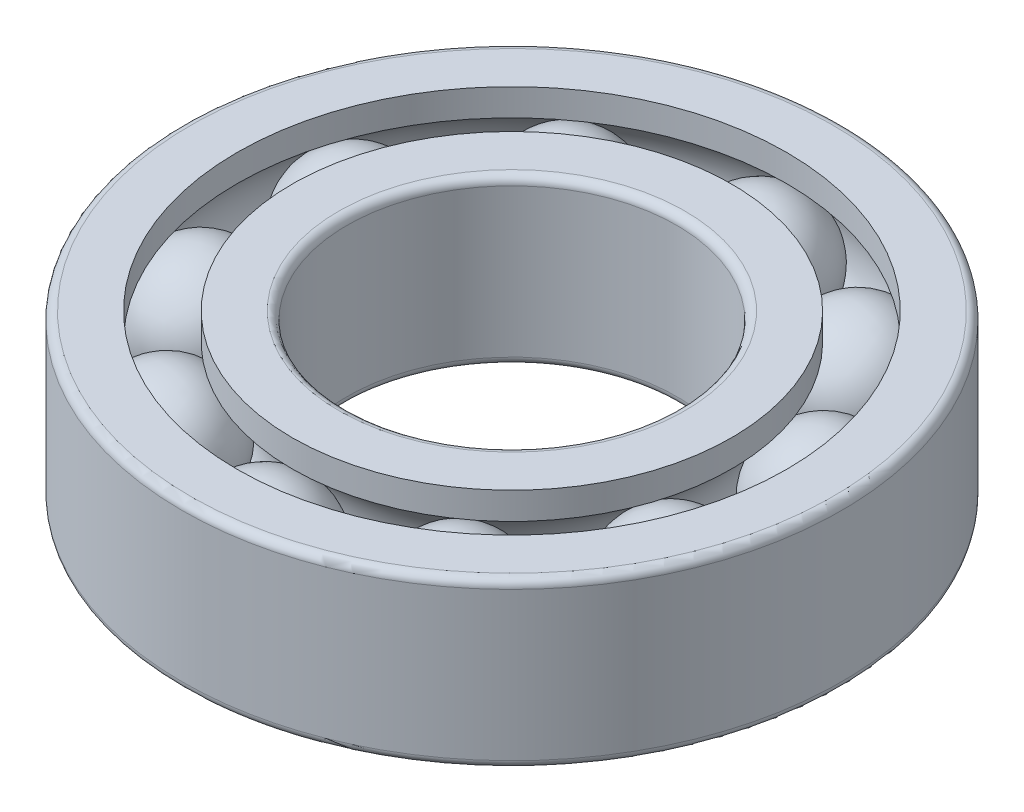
ISO-10303-21;
HEADER;
FILE_DESCRIPTION(('STEP AP214'),'2;1');
FILE_NAME('part.step','',(''),(''),'','','');
FILE_SCHEMA(('AUTOMOTIVE_DESIGN { 1 0 10303 214 1 1 1 1 }'));
ENDSEC;
DATA;
#1=APPLICATION_CONTEXT('core data for automotive mechanical design processes');
#2=APPLICATION_PROTOCOL_DEFINITION('international standard','automotive_design',2000,#1);
#3=PRODUCT_CONTEXT('',#1,'mechanical');
#4=PRODUCT('Part','Part','',(#3));
#5=PRODUCT_RELATED_PRODUCT_CATEGORY('part','',(#4));
#6=PRODUCT_DEFINITION_FORMATION('','',#4);
#7=PRODUCT_DEFINITION_CONTEXT('part definition',#1,'design');
#8=PRODUCT_DEFINITION('design','',#6,#7);
#9=PRODUCT_DEFINITION_SHAPE('','',#8);
#10=(LENGTH_UNIT() NAMED_UNIT(*) SI_UNIT(.MILLI.,.METRE.));
#11=(NAMED_UNIT(*) PLANE_ANGLE_UNIT() SI_UNIT($,.RADIAN.));
#12=(NAMED_UNIT(*) SI_UNIT($,.STERADIAN.) SOLID_ANGLE_UNIT());
#13=UNCERTAINTY_MEASURE_WITH_UNIT(LENGTH_MEASURE(1.E-05),#10,'distance_accuracy_value','');
#14=(GEOMETRIC_REPRESENTATION_CONTEXT(3) GLOBAL_UNCERTAINTY_ASSIGNED_CONTEXT((#13)) GLOBAL_UNIT_ASSIGNED_CONTEXT((#10,
#11,#12)) REPRESENTATION_CONTEXT('',''));
#15=CARTESIAN_POINT('',(0.,0.,0.));
#16=DIRECTION('',(0.,0.,1.));
#17=DIRECTION('',(1.,0.,0.));
#18=AXIS2_PLACEMENT_3D('',#15,#16,#17);
#19=CARTESIAN_POINT('',(5.29006727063,0.,-7.28115294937));
#20=DIRECTION('',(0.127966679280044,0.,-0.991778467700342));
#21=DIRECTION('',(-0.991778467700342,0.,-0.127966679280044));
#22=AXIS2_PLACEMENT_3D('',#19,#20,#21);
#23=SPHERICAL_SURFACE('',#22,2.25);
#24=CARTESIAN_POINT('',(5.0021422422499,0.,-5.04965139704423));
#25=VERTEX_POINT('',#24);
#26=VERTEX_LOOP('',#25);
#27=FACE_BOUND('',#26,.T.);
#28=CARTESIAN_POINT('',(5.5779922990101,0.,-9.51265450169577));
#29=CARTESIAN_POINT('',(5.5779923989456,-0.0368155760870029,-9.51265527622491));
#30=CARTESIAN_POINT('',(5.57787667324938,-0.0736310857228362,-9.51175836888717));
#31=CARTESIAN_POINT('',(5.57741428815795,-0.147173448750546,-9.50817475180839));
#32=CARTESIAN_POINT('',(5.57706762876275,-0.183900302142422,-9.50548804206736));
#33=CARTESIAN_POINT('',(5.57614409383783,-0.257176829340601,-9.49833038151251));
#34=CARTESIAN_POINT('',(5.57556721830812,-0.293726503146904,-9.49385943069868));
#35=CARTESIAN_POINT('',(5.57418467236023,-0.366560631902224,-9.4831443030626));
#36=CARTESIAN_POINT('',(5.57337900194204,-0.402845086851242,-9.47690012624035));
#37=CARTESIAN_POINT('',(5.57154079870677,-0.475061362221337,-9.46265352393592));
#38=CARTESIAN_POINT('',(5.57050826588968,-0.510993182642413,-9.45465109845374));
#39=CARTESIAN_POINT('',(5.56821882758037,-0.582417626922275,-9.43690729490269));
#40=CARTESIAN_POINT('',(5.56696192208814,-0.617910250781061,-9.42716591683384));
#41=CARTESIAN_POINT('',(5.56422676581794,-0.68837079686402,-9.40596767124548));
#42=CARTESIAN_POINT('',(5.56274851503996,-0.723338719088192,-9.39451080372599));
#43=CARTESIAN_POINT('',(5.55957422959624,-0.792665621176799,-9.36990918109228));
#44=CARTESIAN_POINT('',(5.55787819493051,-0.827024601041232,-9.35676442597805));
#45=CARTESIAN_POINT('',(5.55427242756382,-0.895050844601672,-9.32881869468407));
#46=CARTESIAN_POINT('',(5.55236269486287,-0.928718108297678,-9.31401771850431));
#47=CARTESIAN_POINT('',(5.54833413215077,-0.995279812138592,-9.28279520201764));
#48=CARTESIAN_POINT('',(5.54621530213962,-1.0281742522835,-9.26637366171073));
#49=CARTESIAN_POINT('',(5.54177364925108,-1.09311106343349,-9.2319495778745));
#50=CARTESIAN_POINT('',(5.53945082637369,-1.12515343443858,-9.21394703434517));
#51=CARTESIAN_POINT('',(5.53460678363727,-1.18830891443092,-9.17640431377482));
#52=CARTESIAN_POINT('',(5.53208556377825,-1.21942202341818,-9.15686413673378));
#53=CARTESIAN_POINT('',(5.52685080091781,-1.28064402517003,-9.11629322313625));
#54=CARTESIAN_POINT('',(5.5241372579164,-1.31075291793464,-9.09526248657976));
#55=CARTESIAN_POINT('',(5.51852438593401,-1.36989395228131,-9.05176111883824));
#56=CARTESIAN_POINT('',(5.51562505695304,-1.39892609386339,-9.0292904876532));
#57=CARTESIAN_POINT('',(5.50964759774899,-1.45584368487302,-8.98296346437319));
#58=CARTESIAN_POINT('',(5.50656946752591,-1.48372913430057,-8.95910707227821));
#59=CARTESIAN_POINT('',(5.50024182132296,-1.53828616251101,-8.91006599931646));
#60=CARTESIAN_POINT('',(5.4969923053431,-1.5649577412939,-8.88488131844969));
#61=CARTESIAN_POINT('',(5.4903297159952,-1.61702277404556,-8.83324434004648));
#62=CARTESIAN_POINT('',(5.48691664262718,-1.64241622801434,-8.80679204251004));
#63=CARTESIAN_POINT('',(5.47993516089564,-1.69186383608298,-8.75268355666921));
#64=CARTESIAN_POINT('',(5.47636675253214,-1.71591799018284,-8.72502736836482));
#65=CARTESIAN_POINT('',(5.46908319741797,-1.76262904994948,-8.66857772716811));
#66=CARTESIAN_POINT('',(5.4653680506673,-1.78528595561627,-8.63978427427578));
#67=CARTESIAN_POINT('',(5.45779996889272,-1.82914793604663,-8.58112946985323));
#68=CARTESIAN_POINT('',(5.45394703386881,-1.85035301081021,-8.551268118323));
#69=CARTESIAN_POINT('',(5.4461126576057,-1.89126024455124,-8.490549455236));
#70=CARTESIAN_POINT('',(5.4421312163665,-1.91096240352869,-8.45969214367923));
#71=CARTESIAN_POINT('',(5.4340494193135,-1.94881634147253,-8.39705589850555));
#72=CARTESIAN_POINT('',(5.4299490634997,-1.96696812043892,-8.36527696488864));
#73=CARTESIAN_POINT('',(5.42163931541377,-2.00167756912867,-8.30087403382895));
#74=CARTESIAN_POINT('',(5.41742992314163,-2.01823523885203,-8.26825003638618));
#75=CARTESIAN_POINT('',(5.40891224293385,-2.04971658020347,-8.20223557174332));
#76=CARTESIAN_POINT('',(5.40460395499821,-2.06464025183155,-8.16884510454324));
#77=CARTESIAN_POINT('',(5.39589886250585,-2.09281764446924,-8.10137814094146));
#78=CARTESIAN_POINT('',(5.39150205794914,-2.10607136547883,-8.06730164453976));
#79=CARTESIAN_POINT('',(5.38263052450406,-2.13087692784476,-7.99854471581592));
#80=CARTESIAN_POINT('',(5.3781557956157,-2.14242876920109,-7.96386428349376));
#81=CARTESIAN_POINT('',(5.36913919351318,-2.16380274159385,-7.89398303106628));
#82=CARTESIAN_POINT('',(5.36459732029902,-2.17362487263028,-7.85878221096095));
#83=CARTESIAN_POINT('',(5.35545737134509,-2.19151576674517,-7.78794498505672));
#84=CARTESIAN_POINT('',(5.35085929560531,-2.19958452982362,-7.75230857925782));
#85=CARTESIAN_POINT('',(5.3416180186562,-2.21394923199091,-7.68068603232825));
#86=CARTESIAN_POINT('',(5.33697481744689,-2.22024517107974,-7.64469989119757));
#87=CARTESIAN_POINT('',(5.3276544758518,-2.23104912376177,-7.57246457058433));
#88=CARTESIAN_POINT('',(5.32297733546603,-2.23555713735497,-7.53621539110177));
#89=CARTESIAN_POINT('',(5.3136003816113,-2.24277413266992,-7.46354130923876));
#90=CARTESIAN_POINT('',(5.30890056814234,-2.24548311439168,-7.42711640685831));
#91=CARTESIAN_POINT('',(5.29948959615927,-2.24909643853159,-7.35417867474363));
#92=CARTESIAN_POINT('',(5.29477843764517,-2.25000078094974,-7.31766584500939));
#93=CARTESIAN_POINT('',(5.29006727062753,-2.25,-7.28115294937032));
#94=B_SPLINE_CURVE_WITH_KNOTS('',3,(#28,#29,#30,#31,#32,#33,#34,#35,#36,#37,#38,#39,#40,#41,#42,
#43,#44,#45,#46,#47,#48,#49,#50,#51,#52,#53,#54,#55,#56,#57,#58,#59,#60,#61,#62,#63,#64,#65,#66,
#67,#68,#69,#70,#71,#72,#73,#74,#75,#76,#77,#78,#79,#80,#81,#82,#83,#84,#85,#86,#87,#88,#89,#90,
#91,#92,#93),.UNSPECIFIED.,.F.,.F.,(4,2,2,2,2,2,2,2,2,2,2,2,2,2,2,2,2,2,2,2,2,2,2,2,2,2,2,2,2,2,
2,2,4),(0.,0.110435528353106,0.220871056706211,0.331306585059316,0.441742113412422,
0.552177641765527,0.662613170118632,0.773048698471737,0.883484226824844,0.993919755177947,
1.10435528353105,1.21479081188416,1.32522634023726,1.43566186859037,1.54609739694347,
1.65653292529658,1.76696845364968,1.87740398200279,1.98783951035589,2.098275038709,
2.20871056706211,2.31914609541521,2.42958162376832,2.54001715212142,2.65045268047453,
2.76088820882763,2.87132373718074,2.98175926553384,3.09219479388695,3.20263032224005,
3.31306585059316,3.42350137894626,3.53393690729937),.UNSPECIFIED.);
#95=CARTESIAN_POINT('',(5.5779922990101,0.,-9.51265450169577));
#96=VERTEX_POINT('',#95);
#97=CARTESIAN_POINT('',(5.29006727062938,-2.25,-7.28115294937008));
#98=VERTEX_POINT('',#97);
#99=EDGE_CURVE('P0_E11',#96,#98,#94,.T.);
#100=ORIENTED_EDGE('',*,*,#99,.T.);
#101=ORIENTED_EDGE('',*,*,#99,.F.);
#102=EDGE_LOOP('',(#100,#101));
#103=FACE_BOUND('',#102,.T.);
#104=ADVANCED_FACE('P0_F16',(#27,#103),#23,.T.);
#105=CLOSED_SHELL('',(#104));
#106=MANIFOLD_SOLID_BREP('P0_B1',#105);
#107=CARTESIAN_POINT('',(0.,0.,-9.));
#108=DIRECTION('',(-0.479425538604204,0.,-0.877582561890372));
#109=DIRECTION('',(-0.877582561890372,0.,0.479425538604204));
#110=AXIS2_PLACEMENT_3D('',#107,#108,#109);
#111=SPHERICAL_SURFACE('',#110,2.25);
#112=CARTESIAN_POINT('',(1.07870746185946,0.,-7.02543923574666));
#113=VERTEX_POINT('',#112);
#114=VERTEX_LOOP('',#113);
#115=FACE_BOUND('',#114,.T.);
#116=CARTESIAN_POINT('',(-1.07870746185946,0.,-10.9745607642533));
#117=CARTESIAN_POINT('',(-1.07870783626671,-0.0368155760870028,-10.9745614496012));
#118=CARTESIAN_POINT('',(-1.07827427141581,-0.0736310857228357,-10.9737678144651));
#119=CARTESIAN_POINT('',(-1.07654195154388,-0.147173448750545,-10.9705968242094));
#120=CARTESIAN_POINT('',(-1.07524319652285,-0.183900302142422,-10.9682194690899));
#121=CARTESIAN_POINT('',(-1.07178318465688,-0.257176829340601,-10.9618859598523));
#122=CARTESIAN_POINT('',(-1.06962192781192,-0.293726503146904,-10.9579298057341));
#123=CARTESIAN_POINT('',(-1.06444223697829,-0.366560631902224,-10.9484484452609));
#124=CARTESIAN_POINT('',(-1.06142380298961,-0.402845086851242,-10.9429232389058));
#125=CARTESIAN_POINT('',(-1.05453699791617,-0.475061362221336,-10.930317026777));
#126=CARTESIAN_POINT('',(-1.05066862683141,-0.510993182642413,-10.9232360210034));
#127=CARTESIAN_POINT('',(-1.04209127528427,-0.582417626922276,-10.9075352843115));
#128=CARTESIAN_POINT('',(-1.03738229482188,-0.617910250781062,-10.8989155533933));
#129=CARTESIAN_POINT('',(-1.02713506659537,-0.68837079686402,-10.8801581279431));
#130=CARTESIAN_POINT('',(-1.02159681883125,-0.723338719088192,-10.8700204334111));
#131=CARTESIAN_POINT('',(-1.00970439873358,-0.792665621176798,-10.8482515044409));
#132=CARTESIAN_POINT('',(-1.00335022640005,-0.827024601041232,-10.8366202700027));
#133=CARTESIAN_POINT('',(-0.989841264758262,-0.895050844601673,-10.8118922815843));
#134=CARTESIAN_POINT('',(-0.982686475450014,-0.928718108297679,-10.7987955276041));
#135=CARTESIAN_POINT('',(-0.967593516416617,-0.995279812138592,-10.7711680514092));
#136=CARTESIAN_POINT('',(-0.959655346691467,-1.0281742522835,-10.7566373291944));
#137=CARTESIAN_POINT('',(-0.943014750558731,-1.09311106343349,-10.7261769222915));
#138=CARTESIAN_POINT('',(-0.934312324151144,-1.12515343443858,-10.7102472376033));
#139=CARTESIAN_POINT('',(-0.916164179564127,-1.18830891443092,-10.6770272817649));
#140=CARTESIAN_POINT('',(-0.906718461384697,-1.21942202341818,-10.6597370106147));
#141=CARTESIAN_POINT('',(-0.887106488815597,-1.28064402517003,-10.6238375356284));
#142=CARTESIAN_POINT('',(-0.876940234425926,-1.31075291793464,-10.6052283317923));
#143=CARTESIAN_POINT('',(-0.855911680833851,-1.36989395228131,-10.5667358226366));
#144=CARTESIAN_POINT('',(-0.845049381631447,-1.39892609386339,-10.5468525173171));
#145=CARTESIAN_POINT('',(-0.822654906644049,-1.45584368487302,-10.5058597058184));
#146=CARTESIAN_POINT('',(-0.811122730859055,-1.48372913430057,-10.4847501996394));
#147=CARTESIAN_POINT('',(-0.78741628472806,-1.53828616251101,-10.4413558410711));
#148=CARTESIAN_POINT('',(-0.775242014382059,-1.5649577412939,-10.419070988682));
#149=CARTESIAN_POINT('',(-0.750280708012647,-1.61702277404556,-10.3733796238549));
#150=CARTESIAN_POINT('',(-0.737493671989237,-1.64241622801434,-10.3499731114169));
#151=CARTESIAN_POINT('',(-0.711337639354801,-1.69186383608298,-10.3020948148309));
#152=CARTESIAN_POINT('',(-0.697968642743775,-1.71591799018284,-10.2776230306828));
#153=CARTESIAN_POINT('',(-0.67068089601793,-1.76262904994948,-10.2276731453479));
#154=CARTESIAN_POINT('',(-0.656762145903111,-1.78528595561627,-10.2021950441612));
#155=CARTESIAN_POINT('',(-0.628408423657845,-1.82914793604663,-10.1502939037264));
#156=CARTESIAN_POINT('',(-0.6139734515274,-1.85035301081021,-10.1238708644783));
#157=CARTESIAN_POINT('',(-0.584622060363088,-1.89126024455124,-10.0701435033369));
#158=CARTESIAN_POINT('',(-0.569705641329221,-1.91096240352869,-10.0428391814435));
#159=CARTESIAN_POINT('',(-0.539427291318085,-1.94881634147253,-9.98741503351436));
#160=CARTESIAN_POINT('',(-0.524065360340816,-1.96696812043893,-9.95929520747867));
#161=CARTESIAN_POINT('',(-0.492932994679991,-2.00167756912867,-9.90230779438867));
#162=CARTESIAN_POINT('',(-0.477162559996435,-2.01823523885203,-9.87344020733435));
#163=CARTESIAN_POINT('',(-0.445251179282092,-2.04971658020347,-9.81502681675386));
#164=CARTESIAN_POINT('',(-0.429110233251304,-2.06464025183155,-9.78548101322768));
#165=CARTESIAN_POINT('',(-0.39649671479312,-2.09281764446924,-9.72578236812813));
#166=CARTESIAN_POINT('',(-0.380024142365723,-2.10607136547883,-9.69562952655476));
#167=CARTESIAN_POINT('',(-0.346787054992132,-2.13087692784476,-9.63478944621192));
#168=CARTESIAN_POINT('',(-0.330022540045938,-2.14242876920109,-9.60410220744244));
#169=CARTESIAN_POINT('',(-0.296241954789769,-2.16380274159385,-9.54226726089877));
#170=CARTESIAN_POINT('',(-0.279225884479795,-2.17362487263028,-9.51111955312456));
#171=CARTESIAN_POINT('',(-0.244983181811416,-2.19151576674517,-9.44843870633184));
#172=CARTESIAN_POINT('',(-0.227756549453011,-2.19958452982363,-9.41690556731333));
#173=CARTESIAN_POINT('',(-0.193134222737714,-2.21394923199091,-9.35352982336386));
#174=CARTESIAN_POINT('',(-0.175738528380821,-2.22024517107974,-9.32168721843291));
#175=CARTESIAN_POINT('',(-0.140819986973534,-2.23104912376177,-9.25776925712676));
#176=CARTESIAN_POINT('',(-0.12329713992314,-2.23555713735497,-9.22569390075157));
#177=CARTESIAN_POINT('',(-0.088166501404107,-2.24277413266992,-9.16138769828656));
#178=CARTESIAN_POINT('',(-0.0705587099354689,-2.24548311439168,-9.12915685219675));
#179=CARTESIAN_POINT('',(-0.0353006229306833,-2.24909643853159,-9.06461735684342));
#180=CARTESIAN_POINT('',(-0.0176503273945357,-2.25000078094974,-9.0323087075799));
#181=CARTESIAN_POINT('',(0.,-2.25,-9.));
#182=B_SPLINE_CURVE_WITH_KNOTS('',3,(#116,#117,#118,#119,#120,#121,#122,#123,#124,#125,#126,
#127,#128,#129,#130,#131,#132,#133,#134,#135,#136,#137,#138,#139,#140,#141,#142,#143,#144,#145,
#146,#147,#148,#149,#150,#151,#152,#153,#154,#155,#156,#157,#158,#159,#160,#161,#162,#163,#164,
#165,#166,#167,#168,#169,#170,#171,#172,#173,#174,#175,#176,#177,#178,#179,#180,#181),
.UNSPECIFIED.,.F.,.F.,(4,2,2,2,2,2,2,2,2,2,2,2,2,2,2,2,2,2,2,2,2,2,2,2,2,2,2,2,2,2,2,2,4),(0.,
0.110435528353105,0.220871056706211,0.331306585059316,0.441742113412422,0.552177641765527,
0.662613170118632,0.773048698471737,0.883484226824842,0.993919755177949,1.10435528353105,
1.21479081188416,1.32522634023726,1.43566186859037,1.54609739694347,1.65653292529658,
1.76696845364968,1.87740398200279,1.9878395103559,2.098275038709,2.20871056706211,
2.31914609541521,2.42958162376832,2.54001715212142,2.65045268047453,2.76088820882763,
2.87132373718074,2.98175926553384,3.09219479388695,3.20263032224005,3.31306585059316,
3.42350137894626,3.53393690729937),.UNSPECIFIED.);
#183=CARTESIAN_POINT('',(-1.07870746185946,0.,-10.9745607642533));
#184=VERTEX_POINT('',#183);
#185=CARTESIAN_POINT('',(-2.42427605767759E-13,-2.25,-8.99999999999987));
#186=VERTEX_POINT('',#185);
#187=EDGE_CURVE('P1_E11',#184,#186,#182,.T.);
#188=ORIENTED_EDGE('',*,*,#187,.T.);
#189=ORIENTED_EDGE('',*,*,#187,.F.);
#190=EDGE_LOOP('',(#188,#189));
#191=FACE_BOUND('',#190,.T.);
#192=ADVANCED_FACE('P1_F16',(#115,#191),#111,.T.);
#193=CLOSED_SHELL('',(#192));
#194=MANIFOLD_SOLID_BREP('P1_B1',#193);
#195=CARTESIAN_POINT('',(8.55950864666,0.,2.78115294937));
#196=DIRECTION('',(0.982781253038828,0.,-0.184772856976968));
#197=DIRECTION('',(-0.184772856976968,0.,-0.982781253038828));
#198=AXIS2_PLACEMENT_3D('',#195,#196,#197);
#199=SPHERICAL_SURFACE('',#198,2.25);
#200=CARTESIAN_POINT('',(6.34825082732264,0.,3.19689187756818));
#201=VERTEX_POINT('',#200);
#202=VERTEX_LOOP('',#201);
#203=FACE_BOUND('',#202,.T.);
#204=CARTESIAN_POINT('',(10.7707664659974,0.,2.36541402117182));
#205=CARTESIAN_POINT('',(10.7707672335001,-0.036815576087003,2.36541387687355));
#206=CARTESIAN_POINT('',(10.7698784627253,-0.0736310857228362,2.36558097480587));
#207=CARTESIAN_POINT('',(10.7663273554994,-0.147173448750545,2.36624861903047));
#208=CARTESIAN_POINT('',(10.7636650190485,-0.183900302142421,2.36674916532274));
#209=CARTESIAN_POINT('',(10.7565722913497,-0.257176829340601,2.36808267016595));
#210=CARTESIAN_POINT('',(10.7521419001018,-0.293726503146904,2.36891562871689));
#211=CARTESIAN_POINT('',(10.7415239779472,-0.366560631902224,2.37091190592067));
#212=CARTESIAN_POINT('',(10.7353364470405,-0.402845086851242,2.37207522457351));
#213=CARTESIAN_POINT('',(10.721219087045,-0.475061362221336,2.37472943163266));
#214=CARTESIAN_POINT('',(10.7132892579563,-0.510993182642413,2.37622032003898));
#215=CARTESIAN_POINT('',(10.6957064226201,-0.582417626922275,2.37952607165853));
#216=CARTESIAN_POINT('',(10.6860534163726,-0.617910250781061,2.38134093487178));
#217=CARTESIAN_POINT('',(10.665047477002,-0.68837079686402,2.38529026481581));
#218=CARTESIAN_POINT('',(10.653694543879,-0.723338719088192,2.3874247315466));
#219=CARTESIAN_POINT('',(10.6293161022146,-0.792665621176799,2.39200812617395));
#220=CARTESIAN_POINT('',(10.6162905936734,-0.827024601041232,2.3944570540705));
#221=CARTESIAN_POINT('',(10.5885983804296,-0.895050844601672,2.3996634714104));
#222=CARTESIAN_POINT('',(10.573931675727,-0.928718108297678,2.40242096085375));
#223=CARTESIAN_POINT('',(10.5429924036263,-0.995279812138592,2.40823785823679));
#224=CARTESIAN_POINT('',(10.5267198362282,-1.0281742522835,2.41129726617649));
#225=CARTESIAN_POINT('',(10.4926080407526,-1.09311106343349,2.41771063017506));
#226=CARTESIAN_POINT('',(10.4747688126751,-1.12515343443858,2.42106458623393));
#227=CARTESIAN_POINT('',(10.4375666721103,-1.18830891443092,2.42805896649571));
#228=CARTESIAN_POINT('',(10.4182037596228,-1.21942202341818,2.43169939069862));
#229=CARTESIAN_POINT('',(10.3780008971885,-1.28064402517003,2.43925793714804));
#230=CARTESIAN_POINT('',(10.3571609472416,-1.31075291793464,2.44317605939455));
#231=CARTESIAN_POINT('',(10.3140542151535,-1.36989395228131,2.4512805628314));
#232=CARTESIAN_POINT('',(10.2917874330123,-1.39892609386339,2.45546694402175));
#233=CARTESIAN_POINT('',(10.2458806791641,-1.45584368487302,2.46409787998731));
#234=CARTESIAN_POINT('',(10.222240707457,-1.48372913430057,2.46854243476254));
#235=CARTESIAN_POINT('',(10.1736445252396,-1.53828616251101,2.47767901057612));
#236=CARTESIAN_POINT('',(10.1486883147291,-1.5649577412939,2.48237103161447));
#237=CARTESIAN_POINT('',(10.097519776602,-1.61702277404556,2.49199123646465));
#238=CARTESIAN_POINT('',(10.0713074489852,-1.64241622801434,2.49691942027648));
#239=CARTESIAN_POINT('',(10.0176898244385,-1.69186383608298,2.50700007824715));
#240=CARTESIAN_POINT('',(9.99028452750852,-1.71591799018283,2.51215255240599));
#241=CARTESIAN_POINT('',(9.93434698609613,-1.76262904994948,2.52266937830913));
#242=CARTESIAN_POINT('',(9.9058147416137,-1.78528595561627,2.52803373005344));
#243=CARTESIAN_POINT('',(9.84769204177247,-1.82914793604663,2.53896138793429));
#244=CARTESIAN_POINT('',(9.81810158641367,-1.85035301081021,2.54452469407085));
#245=CARTESIAN_POINT('',(9.75793375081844,-1.89126024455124,2.55583685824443));
#246=CARTESIAN_POINT('',(9.72735637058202,-1.91096240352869,2.56158571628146));
#247=CARTESIAN_POINT('',(9.66528834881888,-1.94881634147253,2.57325513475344));
#248=CARTESIAN_POINT('',(9.63379770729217,-1.96696812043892,2.57917569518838));
#249=CARTESIAN_POINT('',(9.56997902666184,-2.00167756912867,2.59117425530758));
#250=CARTESIAN_POINT('',(9.53765098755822,-2.01823523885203,2.59725225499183));
#251=CARTESIAN_POINT('',(9.47223539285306,-2.04971658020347,2.6095510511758));
#252=CARTESIAN_POINT('',(9.43914783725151,-2.06464025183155,2.61577184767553));
#253=CARTESIAN_POINT('',(9.37229292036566,-2.09281764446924,2.62834125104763));
#254=CARTESIAN_POINT('',(9.33852555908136,-2.10607136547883,2.63468985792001));
#255=CARTESIAN_POINT('',(9.27039237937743,-2.13087692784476,2.64749958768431));
#256=CARTESIAN_POINT('',(9.23602656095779,-2.14242876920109,2.65396071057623));
#257=CARTESIAN_POINT('',(9.16677925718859,-2.16380274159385,2.66697990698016));
#258=CARTESIAN_POINT('',(9.13189777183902,-2.17362487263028,2.67353798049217));
#259=CARTESIAN_POINT('',(9.06170316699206,-2.19151576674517,2.68673527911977));
#260=CARTESIAN_POINT('',(9.02639004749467,-2.19958452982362,2.69337450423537));
#261=CARTESIAN_POINT('',(8.95541724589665,-2.21394923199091,2.70671811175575));
#262=CARTESIAN_POINT('',(8.91975756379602,-2.22024517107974,2.71342249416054));
#263=CARTESIAN_POINT('',(8.84817754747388,-2.23104912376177,2.7268802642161));
#264=CARTESIAN_POINT('',(8.81225721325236,-2.23555713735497,2.73363365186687));
#265=CARTESIAN_POINT('',(8.7402424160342,-2.24277413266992,2.74717316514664));
#266=CARTESIAN_POINT('',(8.70414795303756,-2.24548311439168,2.75395929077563));
#267=CARTESIAN_POINT('',(8.63187189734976,-2.24909643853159,2.7675479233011));
#268=CARTESIAN_POINT('',(8.59569030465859,-2.25000078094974,2.77435043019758));
#269=CARTESIAN_POINT('',(8.55950864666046,-2.25,2.78115294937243));
#270=B_SPLINE_CURVE_WITH_KNOTS('',3,(#204,#205,#206,#207,#208,#209,#210,#211,#212,#213,#214,
#215,#216,#217,#218,#219,#220,#221,#222,#223,#224,#225,#226,#227,#228,#229,#230,#231,#232,#233,
#234,#235,#236,#237,#238,#239,#240,#241,#242,#243,#244,#245,#246,#247,#248,#249,#250,#251,#252,
#253,#254,#255,#256,#257,#258,#259,#260,#261,#262,#263,#264,#265,#266,#267,#268,#269),
.UNSPECIFIED.,.F.,.F.,(4,2,2,2,2,2,2,2,2,2,2,2,2,2,2,2,2,2,2,2,2,2,2,2,2,2,2,2,2,2,2,2,4),(0.,
0.110435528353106,0.22087105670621,0.331306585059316,0.441742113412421,0.552177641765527,
0.662613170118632,0.773048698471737,0.883484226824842,0.993919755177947,1.10435528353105,
1.21479081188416,1.32522634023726,1.43566186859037,1.54609739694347,1.65653292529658,
1.76696845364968,1.87740398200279,1.9878395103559,2.098275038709,2.20871056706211,
2.31914609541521,2.42958162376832,2.54001715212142,2.65045268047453,2.76088820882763,
2.87132373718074,2.98175926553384,3.09219479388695,3.20263032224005,3.31306585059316,
3.42350137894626,3.53393690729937),.UNSPECIFIED.);
#271=CARTESIAN_POINT('',(10.7707664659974,0.,2.36541402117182));
#272=VERTEX_POINT('',#271);
#273=CARTESIAN_POINT('',(8.55950864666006,-2.25,2.7811529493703));
#274=VERTEX_POINT('',#273);
#275=EDGE_CURVE('P2_E11',#272,#274,#270,.T.);
#276=ORIENTED_EDGE('',*,*,#275,.T.);
#277=ORIENTED_EDGE('',*,*,#275,.F.);
#278=EDGE_LOOP('',(#276,#277));
#279=FACE_BOUND('',#278,.T.);
#280=ADVANCED_FACE('P2_F16',(#203,#279),#199,.T.);
#281=CLOSED_SHELL('',(#280));
#282=MANIFOLD_SOLID_BREP('P2_B1',#281);
#283=CARTESIAN_POINT('',(-5.29006727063,0.,-7.28115294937));
#284=DIRECTION('',(-0.903693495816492,0.,-0.428179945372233));
#285=DIRECTION('',(-0.428179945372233,0.,0.903693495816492));
#286=AXIS2_PLACEMENT_3D('',#283,#284,#285);
#287=SPHERICAL_SURFACE('',#286,2.25);
#288=CARTESIAN_POINT('',(-7.32337763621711,0.,-8.24455782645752));
#289=VERTEX_POINT('',#288);
#290=VERTEX_LOOP('',#289);
#291=FACE_BOUND('',#290,.T.);
#292=CARTESIAN_POINT('',(-3.25675690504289,0.,-6.31774807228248));
#293=CARTESIAN_POINT('',(-3.25675619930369,-0.036815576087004,-6.31774773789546));
#294=CARTESIAN_POINT('',(-3.25757344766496,-0.0736310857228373,-6.31813495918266));
#295=CARTESIAN_POINT('',(-3.26083878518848,-0.147173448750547,-6.3196821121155));
#296=CARTESIAN_POINT('',(-3.26328687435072,-0.183900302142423,-6.32084204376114));
#297=CARTESIAN_POINT('',(-3.26980882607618,-0.257176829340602,-6.32393221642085));
#298=CARTESIAN_POINT('',(-3.27388268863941,-0.293726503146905,-6.32586245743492));
#299=CARTESIAN_POINT('',(-3.28364615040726,-0.366560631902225,-6.33048849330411));
#300=CARTESIAN_POINT('',(-3.28933574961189,-0.402845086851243,-6.33318428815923));
#301=CARTESIAN_POINT('',(-3.30231703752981,-0.475061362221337,-6.33933496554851));
#302=CARTESIAN_POINT('',(-3.3096087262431,-0.510993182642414,-6.34278984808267));
#303=CARTESIAN_POINT('',(-3.32577661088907,-0.582417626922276,-6.35045037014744));
#304=CARTESIAN_POINT('',(-3.33465280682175,-0.617910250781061,-6.35465600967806));
#305=CARTESIAN_POINT('',(-3.35396832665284,-0.68837079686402,-6.36380791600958));
#306=CARTESIAN_POINT('',(-3.36440765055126,-0.723338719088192,-6.36875418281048));
#307=CARTESIAN_POINT('',(-3.38682427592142,-0.792665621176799,-6.37937542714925));
#308=CARTESIAN_POINT('',(-3.39880157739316,-0.827024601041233,-6.38505040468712));
#309=CARTESIAN_POINT('',(-3.4242653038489,-0.895050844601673,-6.39711539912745));
#310=CARTESIAN_POINT('',(-3.4377517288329,-0.928718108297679,-6.40350541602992));
#311=CARTESIAN_POINT('',(-3.46620121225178,-0.995279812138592,-6.41698509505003));
#312=CARTESIAN_POINT('',(-3.48116427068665,-1.0281742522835,-6.42407475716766));
#313=CARTESIAN_POINT('',(-3.51253097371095,-1.09311106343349,-6.43893664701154));
#314=CARTESIAN_POINT('',(-3.52893461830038,-1.12515343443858,-6.44670887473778));
#315=CARTESIAN_POINT('',(-3.56314297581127,-1.18830891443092,-6.4629171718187));
#316=CARTESIAN_POINT('',(-3.58094768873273,-1.21942202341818,-6.47135324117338));
#317=CARTESIAN_POINT('',(-3.61791528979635,-1.28064402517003,-6.48886889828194));
#318=CARTESIAN_POINT('',(-3.6370781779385,-1.31075291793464,-6.49794848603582));
#319=CARTESIAN_POINT('',(-3.67671596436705,-1.36989395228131,-6.51672930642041));
#320=CARTESIAN_POINT('',(-3.69719086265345,-1.39892609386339,-6.52643053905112));
#321=CARTESIAN_POINT('',(-3.73940334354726,-1.45584368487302,-6.54643127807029));
#322=CARTESIAN_POINT('',(-3.76114092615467,-1.48372913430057,-6.55673078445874));
#323=CARTESIAN_POINT('',(-3.80582640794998,-1.53828616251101,-6.57790325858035));
#324=CARTESIAN_POINT('',(-3.82877430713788,-1.5649577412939,-6.58877622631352));
#325=CARTESIAN_POINT('',(-3.87582513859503,-1.61702277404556,-6.61106942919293));
#326=CARTESIAN_POINT('',(-3.89992807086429,-1.64241622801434,-6.62248966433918));
#327=CARTESIAN_POINT('',(-3.94923090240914,-1.69186383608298,-6.64584988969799));
#328=CARTESIAN_POINT('',(-3.97443080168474,-1.71591799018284,-6.65778987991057));
#329=CARTESIAN_POINT('',(-4.02586685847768,-1.76262904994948,-6.68216085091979));
#330=CARTESIAN_POINT('',(-4.05210301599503,-1.78528595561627,-6.69459183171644));
#331=CARTESIAN_POINT('',(-4.10554838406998,-1.82914793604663,-6.71991483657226));
#332=CARTESIAN_POINT('',(-4.13275759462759,-1.85035301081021,-6.73280686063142));
#333=CARTESIAN_POINT('',(-4.18808351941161,-1.89126024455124,-6.75902089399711));
#334=CARTESIAN_POINT('',(-4.21620023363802,-1.91096240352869,-6.77234290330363));
#335=CARTESIAN_POINT('',(-4.27327343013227,-1.94881634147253,-6.79938481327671));
#336=CARTESIAN_POINT('',(-4.3022299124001,-1.96696812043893,-6.81310471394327));
#337=CARTESIAN_POINT('',(-4.36091288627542,-2.00167756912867,-6.84090935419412));
#338=CARTESIAN_POINT('',(-4.39063937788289,-2.01823523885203,-6.85499409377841));
#339=CARTESIAN_POINT('',(-4.45079075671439,-2.04971658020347,-6.8834944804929));
#340=CARTESIAN_POINT('',(-4.48121564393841,-2.06464025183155,-6.89791012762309));
#341=CARTESIAN_POINT('',(-4.54269051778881,-2.09281764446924,-6.92703760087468));
#342=CARTESIAN_POINT('',(-4.57374050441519,-2.10607136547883,-6.94174942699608));
#343=CARTESIAN_POINT('',(-4.63639077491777,-2.13087692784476,-6.9714338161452));
#344=CARTESIAN_POINT('',(-4.66799105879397,-2.14242876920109,-6.98640637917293));
#345=CARTESIAN_POINT('',(-4.73166579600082,-2.16380274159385,-7.01657617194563));
#346=CARTESIAN_POINT('',(-4.76374024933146,-2.17362487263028,-7.0317734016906));
#347=CARTESIAN_POINT('',(-4.82828605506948,-2.19151576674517,-7.06235591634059));
#348=CARTESIAN_POINT('',(-4.86075740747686,-2.19958452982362,-7.07774120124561));
#349=CARTESIAN_POINT('',(-4.9260187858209,-2.21394923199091,-7.10866276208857));
#350=CARTESIAN_POINT('',(-4.95880881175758,-2.22024517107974,-7.1241990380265));
#351=CARTESIAN_POINT('',(-5.02462854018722,-2.23104912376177,-7.15538515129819));
#352=CARTESIAN_POINT('',(-5.05765824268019,-2.23555713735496,-7.17103498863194));
#353=CARTESIAN_POINT('',(-5.12387776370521,-2.24277413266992,-7.20241052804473));
#354=CARTESIAN_POINT('',(-5.15706758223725,-2.24548311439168,-7.21813623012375));
#355=CARTESIAN_POINT('',(-5.22352733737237,-2.24909643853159,-7.2496255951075));
#356=CARTESIAN_POINT('',(-5.25679727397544,-2.25000078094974,-7.26538925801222));
#357=CARTESIAN_POINT('',(-5.29006727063,-2.25,-7.28115294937));
#358=B_SPLINE_CURVE_WITH_KNOTS('',3,(#292,#293,#294,#295,#296,#297,#298,#299,#300,#301,#302,
#303,#304,#305,#306,#307,#308,#309,#310,#311,#312,#313,#314,#315,#316,#317,#318,#319,#320,#321,
#322,#323,#324,#325,#326,#327,#328,#329,#330,#331,#332,#333,#334,#335,#336,#337,#338,#339,#340,
#341,#342,#343,#344,#345,#346,#347,#348,#349,#350,#351,#352,#353,#354,#355,#356,#357),
.UNSPECIFIED.,.F.,.F.,(4,2,2,2,2,2,2,2,2,2,2,2,2,2,2,2,2,2,2,2,2,2,2,2,2,2,2,2,2,2,2,2,4),(0.,
0.110435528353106,0.22087105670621,0.331306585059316,0.441742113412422,0.552177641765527,
0.662613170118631,0.773048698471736,0.883484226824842,0.993919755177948,1.10435528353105,
1.21479081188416,1.32522634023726,1.43566186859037,1.54609739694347,1.65653292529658,
1.76696845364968,1.87740398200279,1.98783951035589,2.098275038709,2.20871056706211,
2.31914609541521,2.42958162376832,2.54001715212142,2.65045268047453,2.76088820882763,
2.87132373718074,2.98175926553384,3.09219479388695,3.20263032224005,3.31306585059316,
3.42350137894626,3.53393690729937),.UNSPECIFIED.);
#359=CARTESIAN_POINT('',(-3.25675690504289,0.,-6.31774807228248));
#360=VERTEX_POINT('',#359);
#361=CARTESIAN_POINT('',(-5.29006727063,-2.25,-7.28115294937));
#362=VERTEX_POINT('',#361);
#363=EDGE_CURVE('P3_E11',#360,#362,#358,.T.);
#364=ORIENTED_EDGE('',*,*,#363,.T.);
#365=ORIENTED_EDGE('',*,*,#363,.F.);
#366=EDGE_LOOP('',(#364,#365));
#367=FACE_BOUND('',#366,.T.);
#368=ADVANCED_FACE('P3_F16',(#291,#367),#287,.T.);
#369=CLOSED_SHELL('',(#368));
#370=MANIFOLD_SOLID_BREP('P3_B1',#369);
#371=CARTESIAN_POINT('',(-8.55950864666,0.,2.78115294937));
#372=DIRECTION('',(-0.686479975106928,0.,0.727148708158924));
#373=DIRECTION('',(0.727148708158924,0.,0.686479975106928));
#374=AXIS2_PLACEMENT_3D('',#371,#372,#373);
#375=SPHERICAL_SURFACE('',#374,2.25);
#376=CARTESIAN_POINT('',(-10.1040885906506,0.,4.41723754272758));
#377=VERTEX_POINT('',#376);
#378=VERTEX_LOOP('',#377);
#379=FACE_BOUND('',#378,.T.);
#380=CARTESIAN_POINT('',(-7.01492870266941,0.,1.14506835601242));
#381=CARTESIAN_POINT('',(-7.01492816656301,-0.0368155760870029,1.14506778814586));
#382=CARTESIAN_POINT('',(-7.01554897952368,-0.0736310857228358,1.14572537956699));
#383=CARTESIAN_POINT('',(-7.01802945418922,-0.147173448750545,1.14835280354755));
#384=CARTESIAN_POINT('',(-7.01988911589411,-0.183900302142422,1.15032263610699));
#385=CARTESIAN_POINT('',(-7.02484343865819,-0.257176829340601,1.15557046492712));
#386=CARTESIAN_POINT('',(-7.02793809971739,-0.293726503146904,1.15884846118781));
#387=CARTESIAN_POINT('',(-7.03535479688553,-0.366560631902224,1.16670454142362));
#388=CARTESIAN_POINT('',(-7.03967683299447,-0.402845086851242,1.17128262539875));
#389=CARTESIAN_POINT('',(-7.04953791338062,-0.475061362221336,1.18172790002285));
#390=CARTESIAN_POINT('',(-7.05507695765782,-0.510993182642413,1.18759509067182));
#391=CARTESIAN_POINT('',(-7.06735869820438,-0.582417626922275,1.20060443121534));
#392=CARTESIAN_POINT('',(-7.07410139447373,-0.617910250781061,1.20774658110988));
#393=CARTESIAN_POINT('',(-7.08877419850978,-0.688370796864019,1.22328863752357));
#394=CARTESIAN_POINT('',(-7.09670430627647,-0.723338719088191,1.23168854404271));
#395=CARTESIAN_POINT('',(-7.11373282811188,-0.792665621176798,1.24972587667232));
#396=CARTESIAN_POINT('',(-7.12283124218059,-0.827024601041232,1.25936330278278));
#397=CARTESIAN_POINT('',(-7.14217445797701,-0.895050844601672,1.27985245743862));
#398=CARTESIAN_POINT('',(-7.15241925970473,-0.928718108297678,1.29070418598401));
#399=CARTESIAN_POINT('',(-7.17403057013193,-0.995279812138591,1.31359580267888));
#400=CARTESIAN_POINT('',(-7.18539707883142,-1.0281742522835,1.32563569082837));
#401=CARTESIAN_POINT('',(-7.20922442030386,-1.09311106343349,1.35087462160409));
#402=CARTESIAN_POINT('',(-7.22168525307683,-1.12515343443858,1.36407366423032));
#403=CARTESIAN_POINT('',(-7.24767122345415,-1.18830891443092,1.39159910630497));
#404=CARTESIAN_POINT('',(-7.26119636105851,-1.21942202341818,1.4059255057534));
#405=CARTESIAN_POINT('',(-7.28927835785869,-1.28064402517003,1.4356711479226));
#406=CARTESIAN_POINT('',(-7.3038352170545,-1.31075291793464,1.45109039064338));
#407=CARTESIAN_POINT('',(-7.33394558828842,-1.36989395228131,1.48298457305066));
#408=CARTESIAN_POINT('',(-7.34949910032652,-1.39892609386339,1.49945951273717));
#409=CARTESIAN_POINT('',(-7.38156530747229,-1.45584368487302,1.53342539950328));
#410=CARTESIAN_POINT('',(-7.39807800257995,-1.48372913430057,1.55091634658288));
#411=CARTESIAN_POINT('',(-7.43202279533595,-1.53828616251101,1.58687211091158));
#412=CARTESIAN_POINT('',(-7.44945489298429,-1.5649577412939,1.6053369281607));
#413=CARTESIAN_POINT('',(-7.48519649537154,-1.61702277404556,1.64319594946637));
#414=CARTESIAN_POINT('',(-7.50350600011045,-1.64241622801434,1.66259015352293));
#415=CARTESIAN_POINT('',(-7.54095830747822,-1.69186383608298,1.70226122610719));
#416=CARTESIAN_POINT('',(-7.56010111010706,-1.71591799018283,1.72253809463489));
#417=CARTESIAN_POINT('',(-7.59917389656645,-1.76262904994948,1.76392564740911));
#418=CARTESIAN_POINT('',(-7.61910388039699,-1.78528595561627,1.78503633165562));
#419=CARTESIAN_POINT('',(-7.65970301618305,-1.82914793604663,1.82804065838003));
#420=CARTESIAN_POINT('',(-7.68037216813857,-1.85035301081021,1.84993430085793));
#421=CARTESIAN_POINT('',(-7.72239984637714,-1.89126024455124,1.89445180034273));
#422=CARTESIAN_POINT('',(-7.7437583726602,-1.91096240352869,1.91707565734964));
#423=CARTESIAN_POINT('',(-7.78711334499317,-1.94881634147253,1.96299908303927));
#424=CARTESIAN_POINT('',(-7.80910979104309,-1.96696812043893,1.98629865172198));
#425=CARTESIAN_POINT('',(-7.85368761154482,-2.00167756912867,2.03351737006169));
#426=CARTESIAN_POINT('',(-7.87626898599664,-2.01823523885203,2.05743651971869));
#427=CARTESIAN_POINT('',(-7.92196226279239,-2.04971658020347,2.10583677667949));
#428=CARTESIAN_POINT('',(-7.94507416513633,-2.06464025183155,2.13031788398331));
#429=CARTESIAN_POINT('',(-7.99177281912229,-2.09281764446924,2.17978307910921));
#430=CARTESIAN_POINT('',(-8.01535957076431,-2.10607136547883,2.2047671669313));
#431=CARTESIAN_POINT('',(-8.06295110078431,-2.13087692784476,2.25517813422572));
#432=CARTESIAN_POINT('',(-8.08695587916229,-2.14242876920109,2.28060501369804));
#433=CARTESIAN_POINT('',(-8.13532563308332,-2.16380274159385,2.33184030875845));
#434=CARTESIAN_POINT('',(-8.15969060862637,-2.17362487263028,2.35764872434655));
#435=CARTESIAN_POINT('',(-8.20872205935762,-2.19151576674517,2.40958491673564));
#436=CARTESIAN_POINT('',(-8.23338853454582,-2.19958452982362,2.43571269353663));
#437=CARTESIAN_POINT('',(-8.28296356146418,-2.21394923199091,2.48822466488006));
#438=CARTESIAN_POINT('',(-8.30787211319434,-2.22024517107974,2.51460885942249));
#439=CARTESIAN_POINT('',(-8.35787128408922,-2.23104912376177,2.56757010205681));
#440=CARTESIAN_POINT('',(-8.38296190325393,-2.23555713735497,2.5941471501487));
#441=CARTESIAN_POINT('',(-8.43326477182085,-2.24277413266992,2.64743008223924));
#442=CARTESIAN_POINT('',(-8.45847702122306,-2.24548311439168,2.67413596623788));
#443=CARTESIAN_POINT('',(-8.50896238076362,-2.24909643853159,2.72761220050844));
#444=CARTESIAN_POINT('',(-8.53423549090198,-2.25000078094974,2.75438255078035));
#445=CARTESIAN_POINT('',(-8.55950864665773,-2.25,2.78115294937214));
#446=B_SPLINE_CURVE_WITH_KNOTS('',3,(#380,#381,#382,#383,#384,#385,#386,#387,#388,#389,#390,
#391,#392,#393,#394,#395,#396,#397,#398,#399,#400,#401,#402,#403,#404,#405,#406,#407,#408,#409,
#410,#411,#412,#413,#414,#415,#416,#417,#418,#419,#420,#421,#422,#423,#424,#425,#426,#427,#428,
#429,#430,#431,#432,#433,#434,#435,#436,#437,#438,#439,#440,#441,#442,#443,#444,#445),
.UNSPECIFIED.,.F.,.F.,(4,2,2,2,2,2,2,2,2,2,2,2,2,2,2,2,2,2,2,2,2,2,2,2,2,2,2,2,2,2,2,2,4),(0.,
0.110435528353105,0.220871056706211,0.331306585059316,0.441742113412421,0.552177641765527,
0.662613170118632,0.773048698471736,0.883484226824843,0.993919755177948,1.10435528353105,
1.21479081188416,1.32522634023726,1.43566186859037,1.54609739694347,1.65653292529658,
1.76696845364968,1.87740398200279,1.9878395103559,2.098275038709,2.20871056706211,
2.31914609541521,2.42958162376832,2.54001715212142,2.65045268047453,2.76088820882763,
2.87132373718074,2.98175926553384,3.09219479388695,3.20263032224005,3.31306585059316,
3.42350137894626,3.53393690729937),.UNSPECIFIED.);
#447=CARTESIAN_POINT('',(-7.01492870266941,0.,1.14506835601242));
#448=VERTEX_POINT('',#447);
#449=CARTESIAN_POINT('',(-8.55950864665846,-2.25,2.78115294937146));
#450=VERTEX_POINT('',#449);
#451=EDGE_CURVE('P4_E11',#448,#450,#446,.T.);
#452=ORIENTED_EDGE('',*,*,#451,.T.);
#453=ORIENTED_EDGE('',*,*,#451,.F.);
#454=EDGE_LOOP('',(#452,#453));
#455=FACE_BOUND('',#454,.T.);
#456=ADVANCED_FACE('P4_F16',(#379,#455),#375,.T.);
#457=CLOSED_SHELL('',(#456));
#458=MANIFOLD_SOLID_BREP('P4_B1',#457);
#459=CARTESIAN_POINT('',(5.29006727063,0.,7.28115294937));
#460=DIRECTION('',(0.903693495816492,0.,0.428179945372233));
#461=DIRECTION('',(0.428179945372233,0.,-0.903693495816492));
#462=AXIS2_PLACEMENT_3D('',#459,#460,#461);
#463=SPHERICAL_SURFACE('',#462,2.25);
#464=CARTESIAN_POINT('',(3.25675690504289,0.,6.31774807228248));
#465=VERTEX_POINT('',#464);
#466=VERTEX_LOOP('',#465);
#467=FACE_BOUND('',#466,.T.);
#468=CARTESIAN_POINT('',(7.32337763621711,0.,8.24455782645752));
#469=CARTESIAN_POINT('',(7.32337834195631,-0.0368155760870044,8.24455816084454));
#470=CARTESIAN_POINT('',(7.32256109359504,-0.0736310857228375,8.24417093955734));
#471=CARTESIAN_POINT('',(7.31929575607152,-0.147173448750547,8.2426237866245));
#472=CARTESIAN_POINT('',(7.31684766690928,-0.183900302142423,8.24146385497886));
#473=CARTESIAN_POINT('',(7.31032571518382,-0.257176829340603,8.23837368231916));
#474=CARTESIAN_POINT('',(7.3062518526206,-0.293726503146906,8.23644344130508));
#475=CARTESIAN_POINT('',(7.29648839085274,-0.366560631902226,8.23181740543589));
#476=CARTESIAN_POINT('',(7.2907987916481,-0.402845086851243,8.22912161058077));
#477=CARTESIAN_POINT('',(7.27781750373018,-0.475061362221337,8.22297093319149));
#478=CARTESIAN_POINT('',(7.2705258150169,-0.510993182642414,8.21951605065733));
#479=CARTESIAN_POINT('',(7.25435793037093,-0.582417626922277,8.21185552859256));
#480=CARTESIAN_POINT('',(7.24548173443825,-0.617910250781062,8.20764988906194));
#481=CARTESIAN_POINT('',(7.22616621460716,-0.68837079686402,8.19849798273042));
#482=CARTESIAN_POINT('',(7.21572689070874,-0.723338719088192,8.19355171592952));
#483=CARTESIAN_POINT('',(7.19331026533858,-0.792665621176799,8.18293047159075));
#484=CARTESIAN_POINT('',(7.18133296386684,-0.827024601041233,8.17725549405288));
#485=CARTESIAN_POINT('',(7.1558692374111,-0.895050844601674,8.16519049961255));
#486=CARTESIAN_POINT('',(7.14238281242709,-0.92871810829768,8.15880048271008));
#487=CARTESIAN_POINT('',(7.11393332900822,-0.995279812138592,8.14532080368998));
#488=CARTESIAN_POINT('',(7.09897027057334,-1.0281742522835,8.13823114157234));
#489=CARTESIAN_POINT('',(7.06760356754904,-1.09311106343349,8.12336925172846));
#490=CARTESIAN_POINT('',(7.05119992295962,-1.12515343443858,8.11559702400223));
#491=CARTESIAN_POINT('',(7.01699156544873,-1.18830891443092,8.09938872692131));
#492=CARTESIAN_POINT('',(6.99918685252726,-1.21942202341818,8.09095265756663));
#493=CARTESIAN_POINT('',(6.96221925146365,-1.28064402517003,8.07343700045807));
#494=CARTESIAN_POINT('',(6.9430563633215,-1.31075291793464,8.06435741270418));
#495=CARTESIAN_POINT('',(6.90341857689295,-1.36989395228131,8.04557659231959));
#496=CARTESIAN_POINT('',(6.88294367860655,-1.39892609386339,8.03587535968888));
#497=CARTESIAN_POINT('',(6.84073119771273,-1.45584368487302,8.01587462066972));
#498=CARTESIAN_POINT('',(6.81899361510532,-1.48372913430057,8.00557511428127));
#499=CARTESIAN_POINT('',(6.77430813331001,-1.53828616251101,7.98440264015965));
#500=CARTESIAN_POINT('',(6.75136023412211,-1.5649577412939,7.97352967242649));
#501=CARTESIAN_POINT('',(6.70430940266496,-1.61702277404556,7.95123646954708));
#502=CARTESIAN_POINT('',(6.68020647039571,-1.64241622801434,7.93981623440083));
#503=CARTESIAN_POINT('',(6.63090363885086,-1.69186383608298,7.91645600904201));
#504=CARTESIAN_POINT('',(6.60570373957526,-1.71591799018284,7.90451601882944));
#505=CARTESIAN_POINT('',(6.55426768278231,-1.76262904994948,7.88014504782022));
#506=CARTESIAN_POINT('',(6.52803152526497,-1.78528595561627,7.86771406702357));
#507=CARTESIAN_POINT('',(6.47458615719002,-1.82914793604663,7.84239106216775));
#508=CARTESIAN_POINT('',(6.44737694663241,-1.85035301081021,7.82949903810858));
#509=CARTESIAN_POINT('',(6.39205102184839,-1.89126024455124,7.8032850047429));
#510=CARTESIAN_POINT('',(6.36393430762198,-1.91096240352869,7.78996299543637));
#511=CARTESIAN_POINT('',(6.30686111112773,-1.94881634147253,7.76292108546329));
#512=CARTESIAN_POINT('',(6.27790462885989,-1.96696812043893,7.74920118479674));
#513=CARTESIAN_POINT('',(6.21922165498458,-2.00167756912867,7.72139654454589));
#514=CARTESIAN_POINT('',(6.1894951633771,-2.01823523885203,7.70731180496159));
#515=CARTESIAN_POINT('',(6.12934378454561,-2.04971658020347,7.67881141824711));
#516=CARTESIAN_POINT('',(6.09891889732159,-2.06464025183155,7.66439577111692));
#517=CARTESIAN_POINT('',(6.03744402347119,-2.09281764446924,7.63526829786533));
#518=CARTESIAN_POINT('',(6.00639403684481,-2.10607136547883,7.62055647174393));
#519=CARTESIAN_POINT('',(5.94374376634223,-2.13087692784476,7.59087208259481));
#520=CARTESIAN_POINT('',(5.91214348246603,-2.14242876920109,7.57589951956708));
#521=CARTESIAN_POINT('',(5.84846874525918,-2.16380274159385,7.54572972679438));
#522=CARTESIAN_POINT('',(5.81639429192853,-2.17362487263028,7.53053249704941));
#523=CARTESIAN_POINT('',(5.75184848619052,-2.19151576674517,7.49994998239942));
#524=CARTESIAN_POINT('',(5.71937713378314,-2.19958452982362,7.48456469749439));
#525=CARTESIAN_POINT('',(5.6541157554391,-2.21394923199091,7.45364313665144));
#526=CARTESIAN_POINT('',(5.62132572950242,-2.22024517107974,7.43810686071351));
#527=CARTESIAN_POINT('',(5.55550600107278,-2.23104912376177,7.40692074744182));
#528=CARTESIAN_POINT('',(5.52247629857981,-2.23555713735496,7.39127091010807));
#529=CARTESIAN_POINT('',(5.45625677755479,-2.24277413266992,7.35989537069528));
#530=CARTESIAN_POINT('',(5.42306695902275,-2.24548311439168,7.34416966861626));
#531=CARTESIAN_POINT('',(5.35660720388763,-2.24909643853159,7.31268030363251));
#532=CARTESIAN_POINT('',(5.32333726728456,-2.25000078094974,7.29691664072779));
#533=CARTESIAN_POINT('',(5.29006727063,-2.25,7.28115294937));
#534=B_SPLINE_CURVE_WITH_KNOTS('',3,(#468,#469,#470,#471,#472,#473,#474,#475,#476,#477,#478,
#479,#480,#481,#482,#483,#484,#485,#486,#487,#488,#489,#490,#491,#492,#493,#494,#495,#496,#497,
#498,#499,#500,#501,#502,#503,#504,#505,#506,#507,#508,#509,#510,#511,#512,#513,#514,#515,#516,
#517,#518,#519,#520,#521,#522,#523,#524,#525,#526,#527,#528,#529,#530,#531,#532,#533),
.UNSPECIFIED.,.F.,.F.,(4,2,2,2,2,2,2,2,2,2,2,2,2,2,2,2,2,2,2,2,2,2,2,2,2,2,2,2,2,2,2,2,4),(0.,
0.110435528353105,0.220871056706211,0.331306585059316,0.441742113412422,0.552177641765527,
0.662613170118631,0.773048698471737,0.883484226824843,0.993919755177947,1.10435528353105,
1.21479081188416,1.32522634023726,1.43566186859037,1.54609739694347,1.65653292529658,
1.76696845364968,1.87740398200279,1.98783951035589,2.098275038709,2.2087105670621,
2.31914609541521,2.42958162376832,2.54001715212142,2.65045268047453,2.76088820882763,
2.87132373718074,2.98175926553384,3.09219479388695,3.20263032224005,3.31306585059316,
3.42350137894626,3.53393690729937),.UNSPECIFIED.);
#535=CARTESIAN_POINT('',(7.32337763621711,0.,8.24455782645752));
#536=VERTEX_POINT('',#535);
#537=CARTESIAN_POINT('',(5.29006727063,-2.25,7.28115294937));
#538=VERTEX_POINT('',#537);
#539=EDGE_CURVE('P5_E11',#536,#538,#534,.T.);
#540=ORIENTED_EDGE('',*,*,#539,.T.);
#541=ORIENTED_EDGE('',*,*,#539,.F.);
#542=EDGE_LOOP('',(#540,#541));
#543=FACE_BOUND('',#542,.T.);
#544=ADVANCED_FACE('P5_F16',(#467,#543),#463,.T.);
#545=CLOSED_SHELL('',(#544));
#546=MANIFOLD_SOLID_BREP('P5_B1',#545);
#547=CARTESIAN_POINT('',(-5.29006727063,0.,7.28115294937));
#548=DIRECTION('',(-0.127966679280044,0.,0.991778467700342));
#549=DIRECTION('',(0.991778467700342,0.,0.127966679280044));
#550=AXIS2_PLACEMENT_3D('',#547,#548,#549);
#551=SPHERICAL_SURFACE('',#550,2.25);
#552=CARTESIAN_POINT('',(-5.5779922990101,0.,9.51265450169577));
#553=VERTEX_POINT('',#552);
#554=VERTEX_LOOP('',#553);
#555=FACE_BOUND('',#554,.T.);
#556=CARTESIAN_POINT('',(-5.0021422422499,0.,5.04965139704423));
#557=CARTESIAN_POINT('',(-5.00214214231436,-0.0368155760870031,5.04965062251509));
#558=CARTESIAN_POINT('',(-5.00225786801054,-0.0736310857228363,5.05054752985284));
#559=CARTESIAN_POINT('',(-5.00272025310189,-0.147173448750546,5.05413114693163));
#560=CARTESIAN_POINT('',(-5.00306691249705,-0.183900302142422,5.05681785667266));
#561=CARTESIAN_POINT('',(-5.00399044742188,-0.257176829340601,5.06397551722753));
#562=CARTESIAN_POINT('',(-5.00456732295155,-0.293726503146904,5.06844646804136));
#563=CARTESIAN_POINT('',(-5.00594986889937,-0.366560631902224,5.07916159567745));
#564=CARTESIAN_POINT('',(-5.00675553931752,-0.402845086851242,5.0854057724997));
#565=CARTESIAN_POINT('',(-5.00859374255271,-0.475061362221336,5.09965237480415));
#566=CARTESIAN_POINT('',(-5.00962627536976,-0.510993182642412,5.10765480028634));
#567=CARTESIAN_POINT('',(-5.01191571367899,-0.582417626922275,5.12539860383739));
#568=CARTESIAN_POINT('',(-5.01317261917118,-0.617910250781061,5.13513998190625));
#569=CARTESIAN_POINT('',(-5.01590777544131,-0.688370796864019,5.15633822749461));
#570=CARTESIAN_POINT('',(-5.01738602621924,-0.723338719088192,5.16779509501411));
#571=CARTESIAN_POINT('',(-5.02056031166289,-0.792665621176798,5.19239671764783));
#572=CARTESIAN_POINT('',(-5.02225634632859,-0.827024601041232,5.20554147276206));
#573=CARTESIAN_POINT('',(-5.0258621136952,-0.895050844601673,5.23348720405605));
#574=CARTESIAN_POINT('',(-5.02777184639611,-0.928718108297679,5.24828818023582));
#575=CARTESIAN_POINT('',(-5.03180040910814,-0.995279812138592,5.2795106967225));
#576=CARTESIAN_POINT('',(-5.03391923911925,-1.0281742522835,5.29593223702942));
#577=CARTESIAN_POINT('',(-5.03836089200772,-1.09311106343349,5.33035632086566));
#578=CARTESIAN_POINT('',(-5.04068371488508,-1.12515343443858,5.34835886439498));
#579=CARTESIAN_POINT('',(-5.04552775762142,-1.18830891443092,5.38590158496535));
#580=CARTESIAN_POINT('',(-5.04804897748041,-1.21942202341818,5.4054417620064));
#581=CARTESIAN_POINT('',(-5.05328374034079,-1.28064402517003,5.44601267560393));
#582=CARTESIAN_POINT('',(-5.05599728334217,-1.31075291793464,5.46704341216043));
#583=CARTESIAN_POINT('',(-5.06161015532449,-1.36989395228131,5.51054477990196));
#584=CARTESIAN_POINT('',(-5.06450948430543,-1.39892609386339,5.53301541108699));
#585=CARTESIAN_POINT('',(-5.07048694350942,-1.45584368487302,5.57934243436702));
#586=CARTESIAN_POINT('',(-5.07356507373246,-1.48372913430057,5.603198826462));
#587=CARTESIAN_POINT('',(-5.07989271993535,-1.53828616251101,5.65223989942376));
#588=CARTESIAN_POINT('',(-5.08314223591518,-1.5649577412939,5.67742458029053));
#589=CARTESIAN_POINT('',(-5.08980482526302,-1.61702277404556,5.72906155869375));
#590=CARTESIAN_POINT('',(-5.09321789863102,-1.64241622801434,5.75551385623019));
#591=CARTESIAN_POINT('',(-5.1001993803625,-1.69186383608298,5.80962234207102));
#592=CARTESIAN_POINT('',(-5.10376778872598,-1.71591799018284,5.83727853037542));
#593=CARTESIAN_POINT('',(-5.1110513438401,-1.76262904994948,5.89372817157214));
#594=CARTESIAN_POINT('',(-5.11476649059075,-1.78528595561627,5.92252162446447));
#595=CARTESIAN_POINT('',(-5.12233457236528,-1.82914793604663,5.98117642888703));
#596=CARTESIAN_POINT('',(-5.12618750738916,-1.85035301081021,6.01103778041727));
#597=CARTESIAN_POINT('',(-5.13402188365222,-1.89126024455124,6.07175644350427));
#598=CARTESIAN_POINT('',(-5.1380033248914,-1.91096240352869,6.10261375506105));
#599=CARTESIAN_POINT('',(-5.14608512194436,-1.94881634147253,6.16525000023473));
#600=CARTESIAN_POINT('',(-5.15018547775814,-1.96696812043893,6.19702893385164));
#601=CARTESIAN_POINT('',(-5.15849522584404,-2.00167756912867,6.26143186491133));
#602=CARTESIAN_POINT('',(-5.16270461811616,-2.01823523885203,6.2940558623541));
#603=CARTESIAN_POINT('',(-5.1712222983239,-2.04971658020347,6.36007032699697));
#604=CARTESIAN_POINT('',(-5.17553058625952,-2.06464025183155,6.39346079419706));
#605=CARTESIAN_POINT('',(-5.18423567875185,-2.09281764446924,6.46092775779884));
#606=CARTESIAN_POINT('',(-5.18863248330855,-2.10607136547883,6.49500425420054));
#607=CARTESIAN_POINT('',(-5.1975040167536,-2.13087692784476,6.56376118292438));
#608=CARTESIAN_POINT('',(-5.20197874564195,-2.14242876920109,6.59844161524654));
#609=CARTESIAN_POINT('',(-5.21099534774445,-2.16380274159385,6.66832286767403));
#610=CARTESIAN_POINT('',(-5.21553722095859,-2.17362487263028,6.70352368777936));
#611=CARTESIAN_POINT('',(-5.22467716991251,-2.19151576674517,6.77436091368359));
#612=CARTESIAN_POINT('',(-5.22927524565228,-2.19958452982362,6.80999731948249));
#613=CARTESIAN_POINT('',(-5.23851652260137,-2.21394923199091,6.88161986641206));
#614=CARTESIAN_POINT('',(-5.24315972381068,-2.22024517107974,6.91760600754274));
#615=CARTESIAN_POINT('',(-5.25248006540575,-2.23104912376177,6.98984132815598));
#616=CARTESIAN_POINT('',(-5.25715720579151,-2.23555713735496,7.02609050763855));
#617=CARTESIAN_POINT('',(-5.26653415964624,-2.24277413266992,7.09876458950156));
#618=CARTESIAN_POINT('',(-5.2712339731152,-2.24548311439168,7.13518949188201));
#619=CARTESIAN_POINT('',(-5.28064494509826,-2.24909643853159,7.20812722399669));
#620=CARTESIAN_POINT('',(-5.28535610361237,-2.25000078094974,7.24464005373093));
#621=CARTESIAN_POINT('',(-5.29006727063,-2.25,7.28115294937));
#622=B_SPLINE_CURVE_WITH_KNOTS('',3,(#556,#557,#558,#559,#560,#561,#562,#563,#564,#565,#566,
#567,#568,#569,#570,#571,#572,#573,#574,#575,#576,#577,#578,#579,#580,#581,#582,#583,#584,#585,
#586,#587,#588,#589,#590,#591,#592,#593,#594,#595,#596,#597,#598,#599,#600,#601,#602,#603,#604,
#605,#606,#607,#608,#609,#610,#611,#612,#613,#614,#615,#616,#617,#618,#619,#620,#621),
.UNSPECIFIED.,.F.,.F.,(4,2,2,2,2,2,2,2,2,2,2,2,2,2,2,2,2,2,2,2,2,2,2,2,2,2,2,2,2,2,2,2,4),(0.,
0.110435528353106,0.220871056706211,0.331306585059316,0.441742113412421,0.552177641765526,
0.662613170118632,0.773048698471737,0.883484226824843,0.993919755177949,1.10435528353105,
1.21479081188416,1.32522634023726,1.43566186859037,1.54609739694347,1.65653292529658,
1.76696845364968,1.87740398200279,1.9878395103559,2.098275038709,2.20871056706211,
2.31914609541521,2.42958162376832,2.54001715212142,2.65045268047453,2.76088820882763,
2.87132373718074,2.98175926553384,3.09219479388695,3.20263032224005,3.31306585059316,
3.42350137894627,3.53393690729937),.UNSPECIFIED.);
#623=CARTESIAN_POINT('',(-5.0021422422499,0.,5.04965139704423));
#624=VERTEX_POINT('',#623);
#625=CARTESIAN_POINT('',(-5.29006727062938,-2.25,7.28115294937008));
#626=VERTEX_POINT('',#625);
#627=EDGE_CURVE('P6_E11',#624,#626,#622,.T.);
#628=ORIENTED_EDGE('',*,*,#627,.T.);
#629=ORIENTED_EDGE('',*,*,#627,.F.);
#630=EDGE_LOOP('',(#628,#629));
#631=FACE_BOUND('',#630,.T.);
#632=ADVANCED_FACE('P6_F16',(#555,#631),#551,.T.);
#633=CLOSED_SHELL('',(#632));
#634=MANIFOLD_SOLID_BREP('P6_B1',#633);
#635=CARTESIAN_POINT('',(-8.55950864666,0.,-2.78115294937));
#636=DIRECTION('',(-0.982781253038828,0.,0.184772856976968));
#637=DIRECTION('',(0.184772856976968,0.,0.982781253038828));
#638=AXIS2_PLACEMENT_3D('',#635,#636,#637);
#639=SPHERICAL_SURFACE('',#638,2.25);
#640=CARTESIAN_POINT('',(-6.34825082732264,0.,-3.19689187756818));
#641=VERTEX_POINT('',#640);
#642=VERTEX_LOOP('',#641);
#643=FACE_BOUND('',#642,.T.);
#644=CARTESIAN_POINT('',(-10.7707664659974,0.,-2.36541402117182));
#645=CARTESIAN_POINT('',(-10.7707672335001,-0.036815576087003,-2.36541387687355));
#646=CARTESIAN_POINT('',(-10.7698784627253,-0.0736310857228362,-2.36558097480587));
#647=CARTESIAN_POINT('',(-10.7663273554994,-0.147173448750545,-2.36624861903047));
#648=CARTESIAN_POINT('',(-10.7636650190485,-0.183900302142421,-2.36674916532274));
#649=CARTESIAN_POINT('',(-10.7565722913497,-0.257176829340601,-2.36808267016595));
#650=CARTESIAN_POINT('',(-10.7521419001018,-0.293726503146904,-2.36891562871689));
#651=CARTESIAN_POINT('',(-10.7415239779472,-0.366560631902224,-2.37091190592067));
#652=CARTESIAN_POINT('',(-10.7353364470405,-0.402845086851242,-2.37207522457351));
#653=CARTESIAN_POINT('',(-10.721219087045,-0.475061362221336,-2.37472943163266));
#654=CARTESIAN_POINT('',(-10.7132892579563,-0.510993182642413,-2.37622032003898));
#655=CARTESIAN_POINT('',(-10.6957064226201,-0.582417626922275,-2.37952607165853));
#656=CARTESIAN_POINT('',(-10.6860534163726,-0.617910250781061,-2.38134093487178));
#657=CARTESIAN_POINT('',(-10.665047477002,-0.68837079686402,-2.38529026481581));
#658=CARTESIAN_POINT('',(-10.653694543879,-0.723338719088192,-2.3874247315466));
#659=CARTESIAN_POINT('',(-10.6293161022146,-0.792665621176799,-2.39200812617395));
#660=CARTESIAN_POINT('',(-10.6162905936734,-0.827024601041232,-2.3944570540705));
#661=CARTESIAN_POINT('',(-10.5885983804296,-0.895050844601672,-2.3996634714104));
#662=CARTESIAN_POINT('',(-10.573931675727,-0.928718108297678,-2.40242096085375));
#663=CARTESIAN_POINT('',(-10.5429924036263,-0.995279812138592,-2.40823785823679));
#664=CARTESIAN_POINT('',(-10.5267198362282,-1.0281742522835,-2.41129726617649));
#665=CARTESIAN_POINT('',(-10.4926080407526,-1.09311106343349,-2.41771063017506));
#666=CARTESIAN_POINT('',(-10.4747688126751,-1.12515343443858,-2.42106458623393));
#667=CARTESIAN_POINT('',(-10.4375666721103,-1.18830891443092,-2.42805896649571));
#668=CARTESIAN_POINT('',(-10.4182037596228,-1.21942202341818,-2.43169939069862));
#669=CARTESIAN_POINT('',(-10.3780008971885,-1.28064402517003,-2.43925793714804));
#670=CARTESIAN_POINT('',(-10.3571609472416,-1.31075291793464,-2.44317605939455));
#671=CARTESIAN_POINT('',(-10.3140542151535,-1.36989395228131,-2.4512805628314));
#672=CARTESIAN_POINT('',(-10.2917874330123,-1.39892609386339,-2.45546694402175));
#673=CARTESIAN_POINT('',(-10.2458806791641,-1.45584368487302,-2.46409787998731));
#674=CARTESIAN_POINT('',(-10.222240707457,-1.48372913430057,-2.46854243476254));
#675=CARTESIAN_POINT('',(-10.1736445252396,-1.53828616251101,-2.47767901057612));
#676=CARTESIAN_POINT('',(-10.1486883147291,-1.5649577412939,-2.48237103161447));
#677=CARTESIAN_POINT('',(-10.097519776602,-1.61702277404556,-2.49199123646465));
#678=CARTESIAN_POINT('',(-10.0713074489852,-1.64241622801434,-2.49691942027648));
#679=CARTESIAN_POINT('',(-10.0176898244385,-1.69186383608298,-2.50700007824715));
#680=CARTESIAN_POINT('',(-9.99028452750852,-1.71591799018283,-2.51215255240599));
#681=CARTESIAN_POINT('',(-9.93434698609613,-1.76262904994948,-2.52266937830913));
#682=CARTESIAN_POINT('',(-9.9058147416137,-1.78528595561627,-2.52803373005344));
#683=CARTESIAN_POINT('',(-9.84769204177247,-1.82914793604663,-2.53896138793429));
#684=CARTESIAN_POINT('',(-9.81810158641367,-1.85035301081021,-2.54452469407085));
#685=CARTESIAN_POINT('',(-9.75793375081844,-1.89126024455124,-2.55583685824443));
#686=CARTESIAN_POINT('',(-9.72735637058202,-1.91096240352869,-2.56158571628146));
#687=CARTESIAN_POINT('',(-9.66528834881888,-1.94881634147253,-2.57325513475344));
#688=CARTESIAN_POINT('',(-9.63379770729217,-1.96696812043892,-2.57917569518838));
#689=CARTESIAN_POINT('',(-9.56997902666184,-2.00167756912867,-2.59117425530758));
#690=CARTESIAN_POINT('',(-9.53765098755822,-2.01823523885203,-2.59725225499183));
#691=CARTESIAN_POINT('',(-9.47223539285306,-2.04971658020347,-2.6095510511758));
#692=CARTESIAN_POINT('',(-9.43914783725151,-2.06464025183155,-2.61577184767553));
#693=CARTESIAN_POINT('',(-9.37229292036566,-2.09281764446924,-2.62834125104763));
#694=CARTESIAN_POINT('',(-9.33852555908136,-2.10607136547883,-2.63468985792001));
#695=CARTESIAN_POINT('',(-9.27039237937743,-2.13087692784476,-2.64749958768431));
#696=CARTESIAN_POINT('',(-9.23602656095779,-2.14242876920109,-2.65396071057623));
#697=CARTESIAN_POINT('',(-9.16677925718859,-2.16380274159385,-2.66697990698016));
#698=CARTESIAN_POINT('',(-9.13189777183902,-2.17362487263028,-2.67353798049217));
#699=CARTESIAN_POINT('',(-9.06170316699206,-2.19151576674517,-2.68673527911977));
#700=CARTESIAN_POINT('',(-9.02639004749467,-2.19958452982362,-2.69337450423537));
#701=CARTESIAN_POINT('',(-8.95541724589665,-2.21394923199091,-2.70671811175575));
#702=CARTESIAN_POINT('',(-8.91975756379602,-2.22024517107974,-2.71342249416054));
#703=CARTESIAN_POINT('',(-8.84817754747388,-2.23104912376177,-2.7268802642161));
#704=CARTESIAN_POINT('',(-8.81225721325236,-2.23555713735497,-2.73363365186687));
#705=CARTESIAN_POINT('',(-8.7402424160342,-2.24277413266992,-2.74717316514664));
#706=CARTESIAN_POINT('',(-8.70414795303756,-2.24548311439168,-2.75395929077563));
#707=CARTESIAN_POINT('',(-8.63187189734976,-2.24909643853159,-2.7675479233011));
#708=CARTESIAN_POINT('',(-8.59569030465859,-2.25000078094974,-2.77435043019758));
#709=CARTESIAN_POINT('',(-8.55950864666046,-2.25,-2.78115294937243));
#710=B_SPLINE_CURVE_WITH_KNOTS('',3,(#644,#645,#646,#647,#648,#649,#650,#651,#652,#653,#654,
#655,#656,#657,#658,#659,#660,#661,#662,#663,#664,#665,#666,#667,#668,#669,#670,#671,#672,#673,
#674,#675,#676,#677,#678,#679,#680,#681,#682,#683,#684,#685,#686,#687,#688,#689,#690,#691,#692,
#693,#694,#695,#696,#697,#698,#699,#700,#701,#702,#703,#704,#705,#706,#707,#708,#709),
.UNSPECIFIED.,.F.,.F.,(4,2,2,2,2,2,2,2,2,2,2,2,2,2,2,2,2,2,2,2,2,2,2,2,2,2,2,2,2,2,2,2,4),(0.,
0.110435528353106,0.22087105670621,0.331306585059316,0.441742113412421,0.552177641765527,
0.662613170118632,0.773048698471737,0.883484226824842,0.993919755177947,1.10435528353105,
1.21479081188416,1.32522634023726,1.43566186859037,1.54609739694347,1.65653292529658,
1.76696845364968,1.87740398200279,1.9878395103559,2.098275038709,2.20871056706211,
2.31914609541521,2.42958162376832,2.54001715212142,2.65045268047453,2.76088820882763,
2.87132373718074,2.98175926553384,3.09219479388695,3.20263032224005,3.31306585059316,
3.42350137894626,3.53393690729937),.UNSPECIFIED.);
#711=CARTESIAN_POINT('',(-10.7707664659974,0.,-2.36541402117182));
#712=VERTEX_POINT('',#711);
#713=CARTESIAN_POINT('',(-8.55950864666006,-2.25,-2.7811529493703));
#714=VERTEX_POINT('',#713);
#715=EDGE_CURVE('P7_E11',#712,#714,#710,.T.);
#716=ORIENTED_EDGE('',*,*,#715,.T.);
#717=ORIENTED_EDGE('',*,*,#715,.F.);
#718=EDGE_LOOP('',(#716,#717));
#719=FACE_BOUND('',#718,.T.);
#720=ADVANCED_FACE('P7_F16',(#643,#719),#639,.T.);
#721=CLOSED_SHELL('',(#720));
#722=MANIFOLD_SOLID_BREP('P7_B1',#721);
#723=CARTESIAN_POINT('',(0.,0.,9.));
#724=DIRECTION('',(0.479425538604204,0.,0.877582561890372));
#725=DIRECTION('',(0.877582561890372,0.,-0.479425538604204));
#726=AXIS2_PLACEMENT_3D('',#723,#724,#725);
#727=SPHERICAL_SURFACE('',#726,2.25);
#728=CARTESIAN_POINT('',(1.07870746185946,0.,10.9745607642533));
#729=VERTEX_POINT('',#728);
#730=VERTEX_LOOP('',#729);
#731=FACE_BOUND('',#730,.T.);
#732=CARTESIAN_POINT('',(-1.07870746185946,0.,7.02543923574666));
#733=CARTESIAN_POINT('',(-1.07870783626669,-0.0368155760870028,7.02543855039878));
#734=CARTESIAN_POINT('',(-1.07827427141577,-0.0736310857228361,7.02623218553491));
#735=CARTESIAN_POINT('',(-1.07654195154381,-0.147173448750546,7.02940317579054));
#736=CARTESIAN_POINT('',(-1.07524319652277,-0.183900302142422,7.03178053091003));
#737=CARTESIAN_POINT('',(-1.07178318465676,-0.257176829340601,7.03811404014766));
#738=CARTESIAN_POINT('',(-1.0696219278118,-0.293726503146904,7.04207019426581));
#739=CARTESIAN_POINT('',(-1.06444223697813,-0.366560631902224,7.05155155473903));
#740=CARTESIAN_POINT('',(-1.06142380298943,-0.402845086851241,7.0570767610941));
#741=CARTESIAN_POINT('',(-1.05453699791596,-0.475061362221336,7.06968297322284));
#742=CARTESIAN_POINT('',(-1.05066862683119,-0.510993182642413,7.07676397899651));
#743=CARTESIAN_POINT('',(-1.04209127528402,-0.582417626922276,7.09246471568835));
#744=CARTESIAN_POINT('',(-1.03738229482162,-0.617910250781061,7.10108444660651));
#745=CARTESIAN_POINT('',(-1.02713506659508,-0.688370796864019,7.11984187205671));
#746=CARTESIAN_POINT('',(-1.02159681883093,-0.723338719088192,7.12997956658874));
#747=CARTESIAN_POINT('',(-1.00970439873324,-0.792665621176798,7.15174849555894));
#748=CARTESIAN_POINT('',(-1.00335022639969,-0.827024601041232,7.16337972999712));
#749=CARTESIAN_POINT('',(-0.989841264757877,-0.895050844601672,7.18810771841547));
#750=CARTESIAN_POINT('',(-0.982686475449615,-0.928718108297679,7.20120447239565));
#751=CARTESIAN_POINT('',(-0.967593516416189,-0.995279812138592,7.22883194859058));
#752=CARTESIAN_POINT('',(-0.959655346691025,-1.0281742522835,7.24336267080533));
#753=CARTESIAN_POINT('',(-0.943014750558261,-1.09311106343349,7.27382307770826));
#754=CARTESIAN_POINT('',(-0.93431232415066,-1.12515343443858,7.28975276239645));
#755=CARTESIAN_POINT('',(-0.916164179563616,-1.18830891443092,7.32297271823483));
#756=CARTESIAN_POINT('',(-0.906718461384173,-1.21942202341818,7.34026298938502));
#757=CARTESIAN_POINT('',(-0.887106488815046,-1.28064402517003,7.37616246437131));
#758=CARTESIAN_POINT('',(-0.876940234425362,-1.31075291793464,7.3947716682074));
#759=CARTESIAN_POINT('',(-0.855911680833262,-1.36989395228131,7.43326417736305));
#760=CARTESIAN_POINT('',(-0.845049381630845,-1.39892609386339,7.45314748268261));
#761=CARTESIAN_POINT('',(-0.822654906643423,-1.45584368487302,7.49414029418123));
#762=CARTESIAN_POINT('',(-0.811122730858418,-1.48372913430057,7.51524980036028));
#763=CARTESIAN_POINT('',(-0.787416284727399,-1.53828616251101,7.55864415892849));
#764=CARTESIAN_POINT('',(-0.775242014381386,-1.5649577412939,7.58092901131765));
#765=CARTESIAN_POINT('',(-0.750280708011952,-1.61702277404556,7.62662037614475));
#766=CARTESIAN_POINT('',(-0.73749367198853,-1.64241622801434,7.65002688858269));
#767=CARTESIAN_POINT('',(-0.711337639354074,-1.69186383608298,7.69790518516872));
#768=CARTESIAN_POINT('',(-0.697968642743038,-1.71591799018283,7.72237696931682));
#769=CARTESIAN_POINT('',(-0.670680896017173,-1.76262904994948,7.77232685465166));
#770=CARTESIAN_POINT('',(-0.656762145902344,-1.78528595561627,7.79780495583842));
#771=CARTESIAN_POINT('',(-0.62840842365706,-1.82914793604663,7.84970609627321));
#772=CARTESIAN_POINT('',(-0.613973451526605,-1.85035301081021,7.87612913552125));
#773=CARTESIAN_POINT('',(-0.584622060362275,-1.89126024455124,7.92985649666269));
#774=CARTESIAN_POINT('',(-0.5697056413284,-1.91096240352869,7.9571608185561));
#775=CARTESIAN_POINT('',(-0.539427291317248,-1.94881634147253,8.01258496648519));
#776=CARTESIAN_POINT('',(-0.524065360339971,-1.96696812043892,8.04070479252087));
#777=CARTESIAN_POINT('',(-0.492932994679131,-2.00167756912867,8.09769220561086));
#778=CARTESIAN_POINT('',(-0.477162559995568,-2.01823523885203,8.12655979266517));
#779=CARTESIAN_POINT('',(-0.445251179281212,-2.04971658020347,8.18497318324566));
#780=CARTESIAN_POINT('',(-0.429110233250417,-2.06464025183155,8.21451898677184));
#781=CARTESIAN_POINT('',(-0.396496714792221,-2.09281764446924,8.27421763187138));
#782=CARTESIAN_POINT('',(-0.380024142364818,-2.10607136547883,8.30437047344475));
#783=CARTESIAN_POINT('',(-0.346787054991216,-2.13087692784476,8.36521055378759));
#784=CARTESIAN_POINT('',(-0.330022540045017,-2.14242876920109,8.39589779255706));
#785=CARTESIAN_POINT('',(-0.296241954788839,-2.16380274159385,8.45773273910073));
#786=CARTESIAN_POINT('',(-0.279225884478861,-2.17362487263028,8.48888044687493));
#787=CARTESIAN_POINT('',(-0.244983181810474,-2.19151576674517,8.55156129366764));
#788=CARTESIAN_POINT('',(-0.227756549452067,-2.19958452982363,8.58309443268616));
#789=CARTESIAN_POINT('',(-0.193134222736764,-2.21394923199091,8.64647017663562));
#790=CARTESIAN_POINT('',(-0.175738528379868,-2.22024517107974,8.67831278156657));
#791=CARTESIAN_POINT('',(-0.140819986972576,-2.23104912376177,8.74223074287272));
#792=CARTESIAN_POINT('',(-0.123297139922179,-2.23555713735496,8.77430609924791));
#793=CARTESIAN_POINT('',(-0.0881665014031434,-2.24277413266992,8.83861230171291));
#794=CARTESIAN_POINT('',(-0.0705587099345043,-2.24548311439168,8.87084314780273));
#795=CARTESIAN_POINT('',(-0.0353006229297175,-2.24909643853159,8.93538264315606));
#796=CARTESIAN_POINT('',(-0.0176503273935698,-2.25000078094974,8.96769129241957));
#797=CARTESIAN_POINT('',(9.65752366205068E-13,-2.25,8.99999999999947));
#798=B_SPLINE_CURVE_WITH_KNOTS('',3,(#732,#733,#734,#735,#736,#737,#738,#739,#740,#741,#742,
#743,#744,#745,#746,#747,#748,#749,#750,#751,#752,#753,#754,#755,#756,#757,#758,#759,#760,#761,
#762,#763,#764,#765,#766,#767,#768,#769,#770,#771,#772,#773,#774,#775,#776,#777,#778,#779,#780,
#781,#782,#783,#784,#785,#786,#787,#788,#789,#790,#791,#792,#793,#794,#795,#796,#797),
.UNSPECIFIED.,.F.,.F.,(4,2,2,2,2,2,2,2,2,2,2,2,2,2,2,2,2,2,2,2,2,2,2,2,2,2,2,2,2,2,2,2,4),(0.,
0.110435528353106,0.220871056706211,0.331306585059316,0.441742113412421,0.552177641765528,
0.662613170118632,0.773048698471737,0.883484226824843,0.993919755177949,1.10435528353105,
1.21479081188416,1.32522634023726,1.43566186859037,1.54609739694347,1.65653292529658,
1.76696845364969,1.87740398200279,1.98783951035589,2.098275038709,2.20871056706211,
2.31914609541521,2.42958162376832,2.54001715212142,2.65045268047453,2.76088820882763,
2.87132373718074,2.98175926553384,3.09219479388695,3.20263032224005,3.31306585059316,
3.42350137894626,3.53393690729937),.UNSPECIFIED.);
#799=CARTESIAN_POINT('',(-1.07870746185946,0.,7.02543923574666));
#800=VERTEX_POINT('',#799);
#801=CARTESIAN_POINT('',(2.40692882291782E-13,-2.25,8.99999999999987));
#802=VERTEX_POINT('',#801);
#803=EDGE_CURVE('P8_E11',#800,#802,#798,.T.);
#804=ORIENTED_EDGE('',*,*,#803,.T.);
#805=ORIENTED_EDGE('',*,*,#803,.F.);
#806=EDGE_LOOP('',(#804,#805));
#807=FACE_BOUND('',#806,.T.);
#808=ADVANCED_FACE('P8_F16',(#731,#807),#727,.T.);
#809=CLOSED_SHELL('',(#808));
#810=MANIFOLD_SOLID_BREP('P8_B1',#809);
#811=CARTESIAN_POINT('',(0.,0.,0.));
#812=DIRECTION('',(0.,1.,0.));
#813=DIRECTION('',(0.479425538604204,0.,0.877582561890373));
#814=AXIS2_PLACEMENT_3D('',#811,#812,#813);
#815=TOROIDAL_SURFACE('',#814,9.,2.25);
#816=CARTESIAN_POINT('',(0.,2.01556443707,0.));
#817=DIRECTION('',(0.,1.,0.));
#818=DIRECTION('',(0.,0.,1.));
#819=AXIS2_PLACEMENT_3D('',#816,#817,#818);
#820=CIRCLE('',#819,10.);
#821=CARTESIAN_POINT('',(0.,2.01556443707,10.));
#822=VERTEX_POINT('',#821);
#823=EDGE_CURVE('P9_E176',#822,#822,#820,.T.);
#824=ORIENTED_EDGE('',*,*,#823,.T.);
#825=EDGE_LOOP('',(#824));
#826=FACE_BOUND('',#825,.T.);
#827=CARTESIAN_POINT('',(0.,-2.01556443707,0.));
#828=DIRECTION('',(0.,1.,0.));
#829=DIRECTION('',(0.,0.,1.));
#830=AXIS2_PLACEMENT_3D('',#827,#828,#829);
#831=CIRCLE('',#830,10.);
#832=CARTESIAN_POINT('',(0.,-2.01556443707,10.));
#833=VERTEX_POINT('',#832);
#834=EDGE_CURVE('P9_E65',#833,#833,#831,.F.);
#835=ORIENTED_EDGE('',*,*,#834,.T.);
#836=EDGE_LOOP('',(#835));
#837=FACE_BOUND('',#836,.T.);
#838=ADVANCED_FACE('P9_F16',(#826,#837),#815,.F.);
#839=CARTESIAN_POINT('',(0.,0.,0.));
#840=DIRECTION('',(0.,1.,0.));
#841=DIRECTION('',(0.,0.,1.));
#842=AXIS2_PLACEMENT_3D('',#839,#840,#841);
#843=CYLINDRICAL_SURFACE('',#842,10.);
#844=CARTESIAN_POINT('',(0.,3.,0.));
#845=DIRECTION('',(0.,1.,0.));
#846=DIRECTION('',(0.,0.,1.));
#847=AXIS2_PLACEMENT_3D('',#844,#845,#846);
#848=CIRCLE('',#847,10.);
#849=CARTESIAN_POINT('',(0.,3.,10.));
#850=VERTEX_POINT('',#849);
#851=EDGE_CURVE('P9_E179',#850,#850,#848,.F.);
#852=ORIENTED_EDGE('',*,*,#851,.F.);
#853=EDGE_LOOP('',(#852));
#854=FACE_BOUND('',#853,.T.);
#855=ORIENTED_EDGE('',*,*,#823,.F.);
#856=EDGE_LOOP('',(#855));
#857=FACE_BOUND('',#856,.T.);
#858=ADVANCED_FACE('P9_F155',(#854,#857),#843,.F.);
#859=CARTESIAN_POINT('',(0.,0.,0.));
#860=DIRECTION('',(0.,1.,0.));
#861=DIRECTION('',(0.,0.,1.));
#862=AXIS2_PLACEMENT_3D('',#859,#860,#861);
#863=CYLINDRICAL_SURFACE('',#862,10.);
#864=ORIENTED_EDGE('',*,*,#834,.F.);
#865=EDGE_LOOP('',(#864));
#866=FACE_BOUND('',#865,.T.);
#867=CARTESIAN_POINT('',(0.,-3.,0.));
#868=DIRECTION('',(0.,1.,0.));
#869=DIRECTION('',(0.,0.,1.));
#870=AXIS2_PLACEMENT_3D('',#867,#868,#869);
#871=CIRCLE('',#870,10.);
#872=CARTESIAN_POINT('',(0.,-3.,10.));
#873=VERTEX_POINT('',#872);
#874=EDGE_CURVE('P9_E52',#873,#873,#871,.F.);
#875=ORIENTED_EDGE('',*,*,#874,.T.);
#876=EDGE_LOOP('',(#875));
#877=FACE_BOUND('',#876,.T.);
#878=ADVANCED_FACE('P9_F148',(#866,#877),#863,.F.);
#879=CARTESIAN_POINT('',(0.,3.,6.3));
#880=DIRECTION('',(0.,1.,0.));
#881=DIRECTION('',(0.,0.,1.));
#882=AXIS2_PLACEMENT_3D('',#879,#880,#881);
#883=PLANE('',#882);
#884=ORIENTED_EDGE('',*,*,#851,.T.);
#885=EDGE_LOOP('',(#884));
#886=FACE_BOUND('',#885,.T.);
#887=CARTESIAN_POINT('',(0.,3.,0.));
#888=DIRECTION('',(0.,-1.,0.));
#889=DIRECTION('',(0.479425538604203,0.,0.877582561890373));
#890=AXIS2_PLACEMENT_3D('',#887,#888,#889);
#891=CIRCLE('',#890,11.6999999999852);
#892=CARTESIAN_POINT('',(5.60927880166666,3.,10.2677159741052));
#893=VERTEX_POINT('',#892);
#894=CARTESIAN_POINT('',(-5.60927880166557,3.,-10.2677159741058));
#895=VERTEX_POINT('',#894);
#896=EDGE_CURVE('P9_E48',#893,#895,#891,.T.);
#897=ORIENTED_EDGE('',*,*,#896,.F.);
#898=CARTESIAN_POINT('',(0.,3.,0.));
#899=DIRECTION('',(0.,-1.,0.));
#900=DIRECTION('',(-0.479425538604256,0.,-0.877582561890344));
#901=AXIS2_PLACEMENT_3D('',#898,#899,#900);
#902=CIRCLE('',#901,11.6999999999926);
#903=EDGE_CURVE('P9_E45',#895,#893,#902,.T.);
#904=ORIENTED_EDGE('',*,*,#903,.F.);
#905=EDGE_LOOP('',(#897,#904));
#906=FACE_BOUND('',#905,.T.);
#907=ADVANCED_FACE('P9_F50',(#886,#906),#883,.T.);
#908=CARTESIAN_POINT('',(0.,-3.,6.3));
#909=DIRECTION('',(0.,1.,0.));
#910=DIRECTION('',(0.,0.,1.));
#911=AXIS2_PLACEMENT_3D('',#908,#909,#910);
#912=PLANE('',#911);
#913=ORIENTED_EDGE('',*,*,#874,.F.);
#914=EDGE_LOOP('',(#913));
#915=FACE_BOUND('',#914,.T.);
#916=CARTESIAN_POINT('',(0.,-3.,0.));
#917=DIRECTION('',(0.,1.,0.));
#918=DIRECTION('',(-0.479425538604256,0.,-0.877582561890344));
#919=AXIS2_PLACEMENT_3D('',#916,#917,#918);
#920=CIRCLE('',#919,11.6999999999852);
#921=CARTESIAN_POINT('',(-5.60927880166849,-3.,-10.2677159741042));
#922=VERTEX_POINT('',#921);
#923=CARTESIAN_POINT('',(5.60927880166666,-3.,10.2677159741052));
#924=VERTEX_POINT('',#923);
#925=EDGE_CURVE('P9_E36',#922,#924,#920,.T.);
#926=ORIENTED_EDGE('',*,*,#925,.F.);
#927=CARTESIAN_POINT('',(0.,-3.,0.));
#928=DIRECTION('',(0.,1.,0.));
#929=DIRECTION('',(0.479425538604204,0.,0.877582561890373));
#930=AXIS2_PLACEMENT_3D('',#927,#928,#929);
#931=CIRCLE('',#930,11.6999999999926);
#932=EDGE_CURVE('P9_E56',#924,#922,#931,.T.);
#933=ORIENTED_EDGE('',*,*,#932,.F.);
#934=EDGE_LOOP('',(#926,#933));
#935=FACE_BOUND('',#934,.T.);
#936=ADVANCED_FACE('P9_F77',(#915,#935),#912,.F.);
#937=CARTESIAN_POINT('',(0.,2.7,0.));
#938=DIRECTION('',(0.,1.,0.));
#939=DIRECTION('',(0.479425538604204,0.,0.877582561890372));
#940=AXIS2_PLACEMENT_3D('',#937,#938,#939);
#941=TOROIDAL_SURFACE('',#940,11.7,0.3);
#942=CARTESIAN_POINT('',(0.,2.7,0.));
#943=DIRECTION('',(0.,1.,0.));
#944=DIRECTION('',(0.,0.,1.));
#945=AXIS2_PLACEMENT_3D('',#942,#943,#944);
#946=CIRCLE('',#945,12.);
#947=CARTESIAN_POINT('',(0.,2.7,12.));
#948=VERTEX_POINT('',#947);
#949=EDGE_CURVE('P9_E28',#948,#948,#946,.F.);
#950=ORIENTED_EDGE('',*,*,#949,.F.);
#951=EDGE_LOOP('',(#950));
#952=FACE_BOUND('',#951,.T.);
#953=ORIENTED_EDGE('',*,*,#903,.T.);
#954=ORIENTED_EDGE('',*,*,#896,.T.);
#955=EDGE_LOOP('',(#953,#954));
#956=FACE_BOUND('',#955,.T.);
#957=ADVANCED_FACE('P9_F55',(#952,#956),#941,.T.);
#958=CARTESIAN_POINT('',(0.,-2.7,0.));
#959=DIRECTION('',(0.,1.,0.));
#960=DIRECTION('',(0.479425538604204,0.,0.877582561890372));
#961=AXIS2_PLACEMENT_3D('',#958,#959,#960);
#962=TOROIDAL_SURFACE('',#961,11.7,0.3);
#963=ORIENTED_EDGE('',*,*,#925,.T.);
#964=ORIENTED_EDGE('',*,*,#932,.T.);
#965=EDGE_LOOP('',(#963,#964));
#966=FACE_BOUND('',#965,.T.);
#967=CARTESIAN_POINT('',(0.,-2.7,0.));
#968=DIRECTION('',(0.,1.,0.));
#969=DIRECTION('',(0.,0.,1.));
#970=AXIS2_PLACEMENT_3D('',#967,#968,#969);
#971=CIRCLE('',#970,12.);
#972=CARTESIAN_POINT('',(0.,-2.7,12.));
#973=VERTEX_POINT('',#972);
#974=EDGE_CURVE('P9_E11',#973,#973,#971,.T.);
#975=ORIENTED_EDGE('',*,*,#974,.F.);
#976=EDGE_LOOP('',(#975));
#977=FACE_BOUND('',#976,.T.);
#978=ADVANCED_FACE('P9_F76',(#966,#977),#962,.T.);
#979=CARTESIAN_POINT('',(0.,0.,0.));
#980=DIRECTION('',(0.,1.,0.));
#981=DIRECTION('',(0.,0.,1.));
#982=AXIS2_PLACEMENT_3D('',#979,#980,#981);
#983=CYLINDRICAL_SURFACE('',#982,12.);
#984=ORIENTED_EDGE('',*,*,#974,.T.);
#985=EDGE_LOOP('',(#984));
#986=FACE_BOUND('',#985,.T.);
#987=ORIENTED_EDGE('',*,*,#949,.T.);
#988=EDGE_LOOP('',(#987));
#989=FACE_BOUND('',#988,.T.);
#990=ADVANCED_FACE('P9_F119',(#986,#989),#983,.T.);
#991=CLOSED_SHELL('',(#838,#858,#878,#907,#936,#957,#978,#990));
#992=MANIFOLD_SOLID_BREP('P9_B1',#991);
#993=CARTESIAN_POINT('',(8.55950864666,0.,-2.78115294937));
#994=DIRECTION('',(0.686479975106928,0.,-0.727148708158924));
#995=DIRECTION('',(-0.727148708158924,0.,-0.686479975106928));
#996=AXIS2_PLACEMENT_3D('',#993,#994,#995);
#997=SPHERICAL_SURFACE('',#996,2.25);
#998=CARTESIAN_POINT('',(10.1040885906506,0.,-4.41723754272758));
#999=VERTEX_POINT('',#998);
#1000=VERTEX_LOOP('',#999);
#1001=FACE_BOUND('',#1000,.T.);
#1002=CARTESIAN_POINT('',(7.01492870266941,0.,-1.14506835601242));
#1003=CARTESIAN_POINT('',(7.01492816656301,-0.0368155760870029,-1.14506778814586));
#1004=CARTESIAN_POINT('',(7.01554897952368,-0.0736310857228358,-1.14572537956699));
#1005=CARTESIAN_POINT('',(7.01802945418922,-0.147173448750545,-1.14835280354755));
#1006=CARTESIAN_POINT('',(7.01988911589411,-0.183900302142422,-1.15032263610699));
#1007=CARTESIAN_POINT('',(7.02484343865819,-0.257176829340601,-1.15557046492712));
#1008=CARTESIAN_POINT('',(7.02793809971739,-0.293726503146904,-1.15884846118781));
#1009=CARTESIAN_POINT('',(7.03535479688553,-0.366560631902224,-1.16670454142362));
#1010=CARTESIAN_POINT('',(7.03967683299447,-0.402845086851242,-1.17128262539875));
#1011=CARTESIAN_POINT('',(7.04953791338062,-0.475061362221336,-1.18172790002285));
#1012=CARTESIAN_POINT('',(7.05507695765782,-0.510993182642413,-1.18759509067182));
#1013=CARTESIAN_POINT('',(7.06735869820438,-0.582417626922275,-1.20060443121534));
#1014=CARTESIAN_POINT('',(7.07410139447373,-0.617910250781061,-1.20774658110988));
#1015=CARTESIAN_POINT('',(7.08877419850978,-0.688370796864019,-1.22328863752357));
#1016=CARTESIAN_POINT('',(7.09670430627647,-0.723338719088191,-1.23168854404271));
#1017=CARTESIAN_POINT('',(7.11373282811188,-0.792665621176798,-1.24972587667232));
#1018=CARTESIAN_POINT('',(7.12283124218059,-0.827024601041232,-1.25936330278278));
#1019=CARTESIAN_POINT('',(7.14217445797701,-0.895050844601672,-1.27985245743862));
#1020=CARTESIAN_POINT('',(7.15241925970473,-0.928718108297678,-1.29070418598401));
#1021=CARTESIAN_POINT('',(7.17403057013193,-0.995279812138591,-1.31359580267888));
#1022=CARTESIAN_POINT('',(7.18539707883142,-1.0281742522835,-1.32563569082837));
#1023=CARTESIAN_POINT('',(7.20922442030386,-1.09311106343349,-1.35087462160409));
#1024=CARTESIAN_POINT('',(7.22168525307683,-1.12515343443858,-1.36407366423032));
#1025=CARTESIAN_POINT('',(7.24767122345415,-1.18830891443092,-1.39159910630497));
#1026=CARTESIAN_POINT('',(7.26119636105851,-1.21942202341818,-1.4059255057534));
#1027=CARTESIAN_POINT('',(7.28927835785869,-1.28064402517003,-1.4356711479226));
#1028=CARTESIAN_POINT('',(7.3038352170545,-1.31075291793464,-1.45109039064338));
#1029=CARTESIAN_POINT('',(7.33394558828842,-1.36989395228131,-1.48298457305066));
#1030=CARTESIAN_POINT('',(7.34949910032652,-1.39892609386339,-1.49945951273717));
#1031=CARTESIAN_POINT('',(7.38156530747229,-1.45584368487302,-1.53342539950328));
#1032=CARTESIAN_POINT('',(7.39807800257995,-1.48372913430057,-1.55091634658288));
#1033=CARTESIAN_POINT('',(7.43202279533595,-1.53828616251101,-1.58687211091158));
#1034=CARTESIAN_POINT('',(7.44945489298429,-1.5649577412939,-1.6053369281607));
#1035=CARTESIAN_POINT('',(7.48519649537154,-1.61702277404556,-1.64319594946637));
#1036=CARTESIAN_POINT('',(7.50350600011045,-1.64241622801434,-1.66259015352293));
#1037=CARTESIAN_POINT('',(7.54095830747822,-1.69186383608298,-1.70226122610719));
#1038=CARTESIAN_POINT('',(7.56010111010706,-1.71591799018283,-1.72253809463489));
#1039=CARTESIAN_POINT('',(7.59917389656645,-1.76262904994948,-1.76392564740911));
#1040=CARTESIAN_POINT('',(7.61910388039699,-1.78528595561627,-1.78503633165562));
#1041=CARTESIAN_POINT('',(7.65970301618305,-1.82914793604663,-1.82804065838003));
#1042=CARTESIAN_POINT('',(7.68037216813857,-1.85035301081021,-1.84993430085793));
#1043=CARTESIAN_POINT('',(7.72239984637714,-1.89126024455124,-1.89445180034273));
#1044=CARTESIAN_POINT('',(7.7437583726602,-1.91096240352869,-1.91707565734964));
#1045=CARTESIAN_POINT('',(7.78711334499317,-1.94881634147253,-1.96299908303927));
#1046=CARTESIAN_POINT('',(7.80910979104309,-1.96696812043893,-1.98629865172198));
#1047=CARTESIAN_POINT('',(7.85368761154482,-2.00167756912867,-2.03351737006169));
#1048=CARTESIAN_POINT('',(7.87626898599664,-2.01823523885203,-2.05743651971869));
#1049=CARTESIAN_POINT('',(7.92196226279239,-2.04971658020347,-2.10583677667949));
#1050=CARTESIAN_POINT('',(7.94507416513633,-2.06464025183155,-2.13031788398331));
#1051=CARTESIAN_POINT('',(7.99177281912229,-2.09281764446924,-2.17978307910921));
#1052=CARTESIAN_POINT('',(8.01535957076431,-2.10607136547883,-2.2047671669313));
#1053=CARTESIAN_POINT('',(8.06295110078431,-2.13087692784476,-2.25517813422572));
#1054=CARTESIAN_POINT('',(8.08695587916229,-2.14242876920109,-2.28060501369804));
#1055=CARTESIAN_POINT('',(8.13532563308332,-2.16380274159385,-2.33184030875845));
#1056=CARTESIAN_POINT('',(8.15969060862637,-2.17362487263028,-2.35764872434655));
#1057=CARTESIAN_POINT('',(8.20872205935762,-2.19151576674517,-2.40958491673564));
#1058=CARTESIAN_POINT('',(8.23338853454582,-2.19958452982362,-2.43571269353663));
#1059=CARTESIAN_POINT('',(8.28296356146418,-2.21394923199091,-2.48822466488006));
#1060=CARTESIAN_POINT('',(8.30787211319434,-2.22024517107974,-2.51460885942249));
#1061=CARTESIAN_POINT('',(8.35787128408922,-2.23104912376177,-2.56757010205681));
#1062=CARTESIAN_POINT('',(8.38296190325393,-2.23555713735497,-2.5941471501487));
#1063=CARTESIAN_POINT('',(8.43326477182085,-2.24277413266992,-2.64743008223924));
#1064=CARTESIAN_POINT('',(8.45847702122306,-2.24548311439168,-2.67413596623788));
#1065=CARTESIAN_POINT('',(8.50896238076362,-2.24909643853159,-2.72761220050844));
#1066=CARTESIAN_POINT('',(8.53423549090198,-2.25000078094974,-2.75438255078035));
#1067=CARTESIAN_POINT('',(8.55950864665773,-2.25,-2.78115294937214));
#1068=B_SPLINE_CURVE_WITH_KNOTS('',3,(#1002,#1003,#1004,#1005,#1006,#1007,#1008,#1009,#1010,
#1011,#1012,#1013,#1014,#1015,#1016,#1017,#1018,#1019,#1020,#1021,#1022,#1023,#1024,#1025,#1026,
#1027,#1028,#1029,#1030,#1031,#1032,#1033,#1034,#1035,#1036,#1037,#1038,#1039,#1040,#1041,#1042,
#1043,#1044,#1045,#1046,#1047,#1048,#1049,#1050,#1051,#1052,#1053,#1054,#1055,#1056,#1057,#1058,
#1059,#1060,#1061,#1062,#1063,#1064,#1065,#1066,#1067),.UNSPECIFIED.,.F.,.F.,(4,2,2,2,2,2,2,2,2,
2,2,2,2,2,2,2,2,2,2,2,2,2,2,2,2,2,2,2,2,2,2,2,4),(0.,0.110435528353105,0.220871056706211,
0.331306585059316,0.441742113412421,0.552177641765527,0.662613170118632,0.773048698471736,
0.883484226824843,0.993919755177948,1.10435528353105,1.21479081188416,1.32522634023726,
1.43566186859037,1.54609739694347,1.65653292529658,1.76696845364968,1.87740398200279,
1.9878395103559,2.098275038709,2.20871056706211,2.31914609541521,2.42958162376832,
2.54001715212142,2.65045268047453,2.76088820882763,2.87132373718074,2.98175926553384,
3.09219479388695,3.20263032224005,3.31306585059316,3.42350137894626,3.53393690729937),.UNSPECIFIED.);
#1069=CARTESIAN_POINT('',(7.01492870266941,0.,-1.14506835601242));
#1070=VERTEX_POINT('',#1069);
#1071=CARTESIAN_POINT('',(8.55950864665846,-2.25,-2.78115294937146));
#1072=VERTEX_POINT('',#1071);
#1073=EDGE_CURVE('P10_E11',#1070,#1072,#1068,.T.);
#1074=ORIENTED_EDGE('',*,*,#1073,.T.);
#1075=ORIENTED_EDGE('',*,*,#1073,.F.);
#1076=EDGE_LOOP('',(#1074,#1075));
#1077=FACE_BOUND('',#1076,.T.);
#1078=ADVANCED_FACE('P10_F16',(#1001,#1077),#997,.T.);
#1079=CLOSED_SHELL('',(#1078));
#1080=MANIFOLD_SOLID_BREP('P10_B1',#1079);
#1081=CARTESIAN_POINT('',(0.,0.,0.));
#1082=DIRECTION('',(0.,1.,0.));
#1083=DIRECTION('',(0.,0.,1.));
#1084=AXIS2_PLACEMENT_3D('',#1081,#1082,#1083);
#1085=CYLINDRICAL_SURFACE('',#1084,6.);
#1086=CARTESIAN_POINT('',(0.,2.7,0.));
#1087=DIRECTION('',(0.,1.,0.));
#1088=DIRECTION('',(0.479425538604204,0.,0.877582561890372));
#1089=AXIS2_PLACEMENT_3D('',#1086,#1087,#1088);
#1090=CIRCLE('',#1089,6.);
#1091=CARTESIAN_POINT('',(2.87655323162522,2.7,5.26549537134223));
#1092=VERTEX_POINT('',#1091);
#1093=EDGE_CURVE('P11_E51',#1092,#1092,#1090,.F.);
#1094=ORIENTED_EDGE('',*,*,#1093,.F.);
#1095=EDGE_LOOP('',(#1094));
#1096=FACE_BOUND('',#1095,.T.);
#1097=CARTESIAN_POINT('',(0.,-2.7,0.));
#1098=DIRECTION('',(0.,1.,0.));
#1099=DIRECTION('',(0.479425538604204,0.,0.877582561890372));
#1100=AXIS2_PLACEMENT_3D('',#1097,#1098,#1099);
#1101=CIRCLE('',#1100,6.);
#1102=CARTESIAN_POINT('',(2.87655323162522,-2.7,5.26549537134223));
#1103=VERTEX_POINT('',#1102);
#1104=EDGE_CURVE('P11_E115',#1103,#1103,#1101,.T.);
#1105=ORIENTED_EDGE('',*,*,#1104,.F.);
#1106=EDGE_LOOP('',(#1105));
#1107=FACE_BOUND('',#1106,.T.);
#1108=ADVANCED_FACE('P11_F16',(#1096,#1107),#1085,.F.);
#1109=CARTESIAN_POINT('',(0.,-2.7,0.));
#1110=DIRECTION('',(0.,1.,0.));
#1111=DIRECTION('',(0.479425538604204,0.,0.877582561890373));
#1112=AXIS2_PLACEMENT_3D('',#1109,#1110,#1111);
#1113=TOROIDAL_SURFACE('',#1112,6.3,0.3);
#1114=ORIENTED_EDGE('',*,*,#1104,.T.);
#1115=EDGE_LOOP('',(#1114));
#1116=FACE_BOUND('',#1115,.T.);
#1117=CARTESIAN_POINT('',(0.,-3.,0.));
#1118=DIRECTION('',(0.,-1.,0.));
#1119=DIRECTION('',(0.479425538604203,0.,0.877582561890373));
#1120=AXIS2_PLACEMENT_3D('',#1117,#1118,#1119);
#1121=CIRCLE('',#1120,6.30000000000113);
#1122=CARTESIAN_POINT('',(3.02038089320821,-3.,5.5287701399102));
#1123=VERTEX_POINT('',#1122);
#1124=CARTESIAN_POINT('',(-3.02038089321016,-3.,-5.52877013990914));
#1125=VERTEX_POINT('',#1124);
#1126=EDGE_CURVE('P11_E43',#1123,#1125,#1121,.T.);
#1127=ORIENTED_EDGE('',*,*,#1126,.T.);
#1128=CARTESIAN_POINT('',(0.,-3.,0.));
#1129=DIRECTION('',(0.,-1.,0.));
#1130=DIRECTION('',(-0.479425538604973,0.,-0.877582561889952));
#1131=AXIS2_PLACEMENT_3D('',#1128,#1129,#1130);
#1132=CIRCLE('',#1131,6.30000000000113);
#1133=EDGE_CURVE('P11_E46',#1125,#1123,#1132,.T.);
#1134=ORIENTED_EDGE('',*,*,#1133,.T.);
#1135=EDGE_LOOP('',(#1127,#1134));
#1136=FACE_BOUND('',#1135,.T.);
#1137=ADVANCED_FACE('P11_F55',(#1116,#1136),#1113,.T.);
#1138=CARTESIAN_POINT('',(0.,2.7,0.));
#1139=DIRECTION('',(0.,1.,0.));
#1140=DIRECTION('',(0.479425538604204,0.,0.877582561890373));
#1141=AXIS2_PLACEMENT_3D('',#1138,#1139,#1140);
#1142=TOROIDAL_SURFACE('',#1141,6.3,0.3);
#1143=CARTESIAN_POINT('',(0.,3.,0.));
#1144=DIRECTION('',(0.,1.,0.));
#1145=DIRECTION('',(0.479425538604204,0.,0.877582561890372));
#1146=AXIS2_PLACEMENT_3D('',#1143,#1144,#1145);
#1147=CIRCLE('',#1146,6.30000000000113);
#1148=CARTESIAN_POINT('',(-3.02038089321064,3.,-5.52877013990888));
#1149=VERTEX_POINT('',#1148);
#1150=CARTESIAN_POINT('',(3.02038089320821,3.,5.5287701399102));
#1151=VERTEX_POINT('',#1150);
#1152=EDGE_CURVE('P11_E34',#1149,#1151,#1147,.F.);
#1153=ORIENTED_EDGE('',*,*,#1152,.F.);
#1154=CARTESIAN_POINT('',(0.,3.,0.));
#1155=DIRECTION('',(0.,1.,0.));
#1156=DIRECTION('',(-0.479425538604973,0.,-0.877582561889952));
#1157=AXIS2_PLACEMENT_3D('',#1154,#1155,#1156);
#1158=CIRCLE('',#1157,6.30000000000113);
#1159=EDGE_CURVE('P11_E88',#1151,#1149,#1158,.F.);
#1160=ORIENTED_EDGE('',*,*,#1159,.F.);
#1161=EDGE_LOOP('',(#1153,#1160));
#1162=FACE_BOUND('',#1161,.T.);
#1163=ORIENTED_EDGE('',*,*,#1093,.T.);
#1164=EDGE_LOOP('',(#1163));
#1165=FACE_BOUND('',#1164,.T.);
#1166=ADVANCED_FACE('P11_F71',(#1162,#1165),#1142,.T.);
#1167=CARTESIAN_POINT('',(0.,-3.,6.3));
#1168=DIRECTION('',(0.,1.,0.));
#1169=DIRECTION('',(0.,0.,1.));
#1170=AXIS2_PLACEMENT_3D('',#1167,#1168,#1169);
#1171=PLANE('',#1170);
#1172=ORIENTED_EDGE('',*,*,#1133,.F.);
#1173=ORIENTED_EDGE('',*,*,#1126,.F.);
#1174=EDGE_LOOP('',(#1172,#1173));
#1175=FACE_BOUND('',#1174,.T.);
#1176=CARTESIAN_POINT('',(0.,-3.,0.));
#1177=DIRECTION('',(0.,1.,0.));
#1178=DIRECTION('',(0.,0.,1.));
#1179=AXIS2_PLACEMENT_3D('',#1176,#1177,#1178);
#1180=CIRCLE('',#1179,8.);
#1181=CARTESIAN_POINT('',(0.,-3.,8.));
#1182=VERTEX_POINT('',#1181);
#1183=EDGE_CURVE('P11_E99',#1182,#1182,#1180,.T.);
#1184=ORIENTED_EDGE('',*,*,#1183,.F.);
#1185=EDGE_LOOP('',(#1184));
#1186=FACE_BOUND('',#1185,.T.);
#1187=ADVANCED_FACE('P11_F48',(#1175,#1186),#1171,.F.);
#1188=CARTESIAN_POINT('',(0.,3.,6.3));
#1189=DIRECTION('',(0.,1.,0.));
#1190=DIRECTION('',(0.,0.,1.));
#1191=AXIS2_PLACEMENT_3D('',#1188,#1189,#1190);
#1192=PLANE('',#1191);
#1193=ORIENTED_EDGE('',*,*,#1152,.T.);
#1194=ORIENTED_EDGE('',*,*,#1159,.T.);
#1195=EDGE_LOOP('',(#1193,#1194));
#1196=FACE_BOUND('',#1195,.T.);
#1197=CARTESIAN_POINT('',(0.,3.,0.));
#1198=DIRECTION('',(0.,1.,0.));
#1199=DIRECTION('',(0.,0.,1.));
#1200=AXIS2_PLACEMENT_3D('',#1197,#1198,#1199);
#1201=CIRCLE('',#1200,8.);
#1202=CARTESIAN_POINT('',(0.,3.,8.));
#1203=VERTEX_POINT('',#1202);
#1204=EDGE_CURVE('P11_E101',#1203,#1203,#1201,.F.);
#1205=ORIENTED_EDGE('',*,*,#1204,.F.);
#1206=EDGE_LOOP('',(#1205));
#1207=FACE_BOUND('',#1206,.T.);
#1208=ADVANCED_FACE('P11_F145',(#1196,#1207),#1192,.T.);
#1209=CARTESIAN_POINT('',(0.,0.,0.));
#1210=DIRECTION('',(0.,1.,0.));
#1211=DIRECTION('',(0.,0.,1.));
#1212=AXIS2_PLACEMENT_3D('',#1209,#1210,#1211);
#1213=CYLINDRICAL_SURFACE('',#1212,8.);
#1214=ORIENTED_EDGE('',*,*,#1183,.T.);
#1215=EDGE_LOOP('',(#1214));
#1216=FACE_BOUND('',#1215,.T.);
#1217=CARTESIAN_POINT('',(0.,-2.01556443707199,0.));
#1218=DIRECTION('',(0.,1.,0.));
#1219=DIRECTION('',(0.479425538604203,0.,0.877582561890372));
#1220=AXIS2_PLACEMENT_3D('',#1217,#1218,#1219);
#1221=CIRCLE('',#1220,7.99999999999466);
#1222=CARTESIAN_POINT('',(3.83540430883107,-2.01556443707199,7.02066049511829));
#1223=VERTEX_POINT('',#1222);
#1224=EDGE_CURVE('P11_E26',#1223,#1223,#1221,.F.);
#1225=ORIENTED_EDGE('',*,*,#1224,.T.);
#1226=EDGE_LOOP('',(#1225));
#1227=FACE_BOUND('',#1226,.T.);
#1228=ADVANCED_FACE('P11_F134',(#1216,#1227),#1213,.T.);
#1229=CARTESIAN_POINT('',(0.,0.,0.));
#1230=DIRECTION('',(0.,1.,0.));
#1231=DIRECTION('',(0.,0.,1.));
#1232=AXIS2_PLACEMENT_3D('',#1229,#1230,#1231);
#1233=CYLINDRICAL_SURFACE('',#1232,8.);
#1234=CARTESIAN_POINT('',(0.,2.01556443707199,0.));
#1235=DIRECTION('',(0.,1.,0.));
#1236=DIRECTION('',(0.479425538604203,0.,0.877582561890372));
#1237=AXIS2_PLACEMENT_3D('',#1234,#1235,#1236);
#1238=CIRCLE('',#1237,7.99999999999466);
#1239=CARTESIAN_POINT('',(3.83540430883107,2.01556443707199,7.02066049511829));
#1240=VERTEX_POINT('',#1239);
#1241=EDGE_CURVE('P11_E11',#1240,#1240,#1238,.T.);
#1242=ORIENTED_EDGE('',*,*,#1241,.T.);
#1243=EDGE_LOOP('',(#1242));
#1244=FACE_BOUND('',#1243,.T.);
#1245=ORIENTED_EDGE('',*,*,#1204,.T.);
#1246=EDGE_LOOP('',(#1245));
#1247=FACE_BOUND('',#1246,.T.);
#1248=ADVANCED_FACE('P11_F128',(#1244,#1247),#1233,.T.);
#1249=CARTESIAN_POINT('',(0.,0.,0.));
#1250=DIRECTION('',(0.,1.,0.));
#1251=DIRECTION('',(0.479425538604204,0.,0.877582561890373));
#1252=AXIS2_PLACEMENT_3D('',#1249,#1250,#1251);
#1253=TOROIDAL_SURFACE('',#1252,9.,2.25);
#1254=ORIENTED_EDGE('',*,*,#1224,.F.);
#1255=EDGE_LOOP('',(#1254));
#1256=FACE_BOUND('',#1255,.T.);
#1257=ORIENTED_EDGE('',*,*,#1241,.F.);
#1258=EDGE_LOOP('',(#1257));
#1259=FACE_BOUND('',#1258,.T.);
#1260=ADVANCED_FACE('P11_F126',(#1256,#1259),#1253,.F.);
#1261=CLOSED_SHELL('',(#1108,#1137,#1166,#1187,#1208,#1228,#1248,#1260));
#1262=MANIFOLD_SOLID_BREP('P11_B1',#1261);
#1263=ADVANCED_BREP_SHAPE_REPRESENTATION('',(#18,#106,#194,#282,#370,#458,#546,#634,#722,#810,
#992,#1080,#1262),#14);
#1264=SHAPE_DEFINITION_REPRESENTATION(#9,#1263);
ENDSEC;
END-ISO-10303-21;
